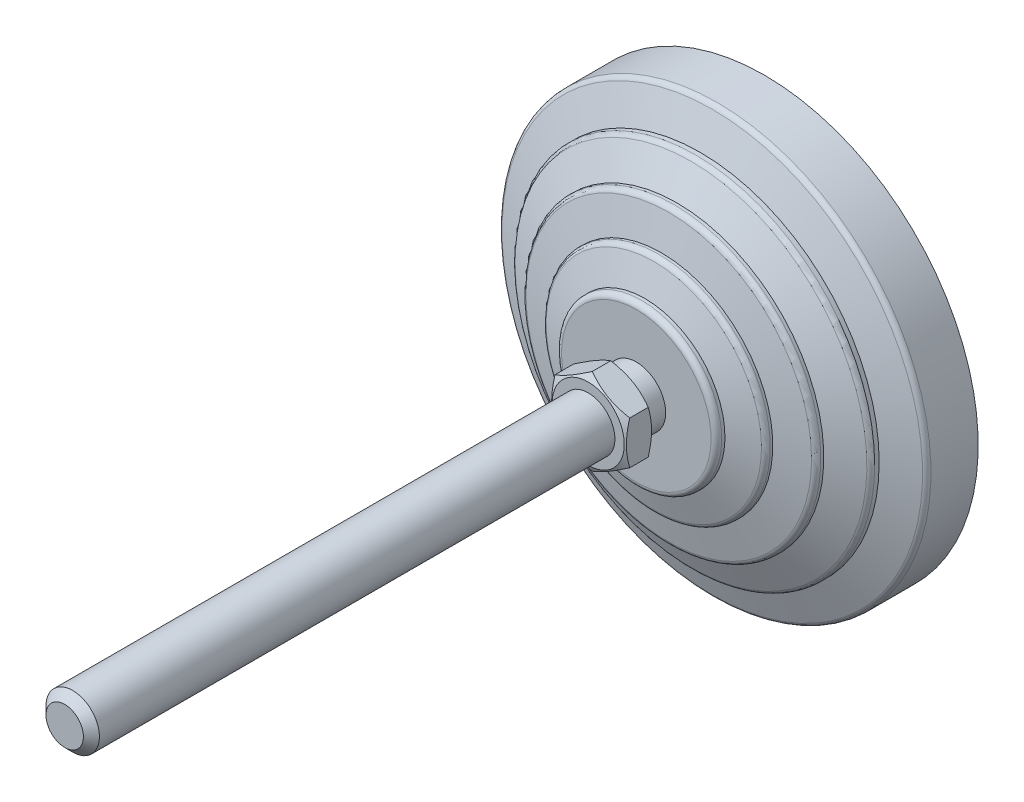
ISO-10303-21;
HEADER;
FILE_DESCRIPTION(('STEP AP214'),'2;1');
FILE_NAME('part.step','',(''),(''),'','','');
FILE_SCHEMA(('AUTOMOTIVE_DESIGN { 1 0 10303 214 1 1 1 1 }'));
ENDSEC;
DATA;
#1=APPLICATION_CONTEXT('core data for automotive mechanical design processes');
#2=APPLICATION_PROTOCOL_DEFINITION('international standard','automotive_design',2000,#1);
#3=PRODUCT_CONTEXT('',#1,'mechanical');
#4=PRODUCT('Part','Part','',(#3));
#5=PRODUCT_RELATED_PRODUCT_CATEGORY('part','',(#4));
#6=PRODUCT_DEFINITION_FORMATION('','',#4);
#7=PRODUCT_DEFINITION_CONTEXT('part definition',#1,'design');
#8=PRODUCT_DEFINITION('design','',#6,#7);
#9=PRODUCT_DEFINITION_SHAPE('','',#8);
#10=(LENGTH_UNIT() NAMED_UNIT(*) SI_UNIT(.MILLI.,.METRE.));
#11=(NAMED_UNIT(*) PLANE_ANGLE_UNIT() SI_UNIT($,.RADIAN.));
#12=(NAMED_UNIT(*) SI_UNIT($,.STERADIAN.) SOLID_ANGLE_UNIT());
#13=UNCERTAINTY_MEASURE_WITH_UNIT(LENGTH_MEASURE(1.E-05),#10,'distance_accuracy_value','');
#14=(GEOMETRIC_REPRESENTATION_CONTEXT(3) GLOBAL_UNCERTAINTY_ASSIGNED_CONTEXT((#13)) GLOBAL_UNIT_ASSIGNED_CONTEXT((#10,
#11,#12)) REPRESENTATION_CONTEXT('',''));
#15=CARTESIAN_POINT('',(0.,0.,0.));
#16=DIRECTION('',(0.,0.,1.));
#17=DIRECTION('',(1.,0.,0.));
#18=AXIS2_PLACEMENT_3D('',#15,#16,#17);
#19=CARTESIAN_POINT('',(-5.5,0.,31.));
#20=DIRECTION('',(0.,0.,1.));
#21=DIRECTION('',(0.,-1.,0.));
#22=AXIS2_PLACEMENT_3D('',#19,#20,#21);
#23=PLANE('',#22);
#24=CARTESIAN_POINT('',(0.,0.,31.));
#25=DIRECTION('',(0.,0.,-1.));
#26=DIRECTION('',(-1.,0.,0.));
#27=AXIS2_PLACEMENT_3D('',#24,#25,#26);
#28=CIRCLE('',#27,6.75);
#29=CARTESIAN_POINT('',(-6.75,0.,31.));
#30=VERTEX_POINT('',#29);
#31=EDGE_CURVE('E570',#30,#30,#28,.T.);
#32=ORIENTED_EDGE('',*,*,#31,.T.);
#33=EDGE_LOOP('',(#32));
#34=FACE_BOUND('',#33,.T.);
#35=CARTESIAN_POINT('',(0.,0.,31.));
#36=DIRECTION('',(0.,0.,-1.));
#37=DIRECTION('',(0.,1.,0.));
#38=AXIS2_PLACEMENT_3D('',#35,#36,#37);
#39=CIRCLE('',#38,5.5);
#40=CARTESIAN_POINT('',(0.,5.5,31.));
#41=VERTEX_POINT('',#40);
#42=EDGE_CURVE('E150',#41,#41,#39,.T.);
#43=ORIENTED_EDGE('',*,*,#42,.F.);
#44=EDGE_LOOP('',(#43));
#45=FACE_BOUND('',#44,.T.);
#46=ADVANCED_FACE('F14',(#34,#45),#23,.F.);
#47=CARTESIAN_POINT('',(0.,0.,0.));
#48=DIRECTION('',(0.,0.,-1.));
#49=DIRECTION('',(0.,1.,0.));
#50=AXIS2_PLACEMENT_3D('',#47,#48,#49);
#51=CYLINDRICAL_SURFACE('',#50,5.5);
#52=CARTESIAN_POINT('',(0.,0.,27.));
#53=DIRECTION('',(0.,0.,-1.));
#54=DIRECTION('',(0.,1.,0.));
#55=AXIS2_PLACEMENT_3D('',#52,#53,#54);
#56=CIRCLE('',#55,5.5);
#57=CARTESIAN_POINT('',(0.,5.5,27.));
#58=VERTEX_POINT('',#57);
#59=EDGE_CURVE('E147',#58,#58,#56,.T.);
#60=ORIENTED_EDGE('',*,*,#59,.F.);
#61=EDGE_LOOP('',(#60));
#62=FACE_BOUND('',#61,.T.);
#63=ORIENTED_EDGE('',*,*,#42,.T.);
#64=EDGE_LOOP('',(#63));
#65=FACE_BOUND('',#64,.T.);
#66=ADVANCED_FACE('F174',(#62,#65),#51,.T.);
#67=CARTESIAN_POINT('',(-5.5,0.,27.));
#68=DIRECTION('',(0.,0.,-1.));
#69=DIRECTION('',(0.,1.,0.));
#70=AXIS2_PLACEMENT_3D('',#67,#68,#69);
#71=PLANE('',#70);
#72=CARTESIAN_POINT('',(0.,0.,27.));
#73=DIRECTION('',(0.,0.,-1.));
#74=DIRECTION('',(0.,1.,0.));
#75=AXIS2_PLACEMENT_3D('',#72,#73,#74);
#76=CIRCLE('',#75,14.);
#77=CARTESIAN_POINT('',(0.,14.,27.));
#78=VERTEX_POINT('',#77);
#79=EDGE_CURVE('E144',#78,#78,#76,.T.);
#80=ORIENTED_EDGE('',*,*,#79,.F.);
#81=EDGE_LOOP('',(#80));
#82=FACE_BOUND('',#81,.T.);
#83=ORIENTED_EDGE('',*,*,#59,.T.);
#84=EDGE_LOOP('',(#83));
#85=FACE_BOUND('',#84,.T.);
#86=ADVANCED_FACE('F181',(#82,#85),#71,.F.);
#87=CARTESIAN_POINT('',(0.,0.,26.));
#88=DIRECTION('',(0.,0.,-1.));
#89=DIRECTION('',(0.,1.,0.));
#90=AXIS2_PLACEMENT_3D('',#87,#88,#89);
#91=TOROIDAL_SURFACE('',#90,14.,1.);
#92=CARTESIAN_POINT('',(0.,0.,26.));
#93=DIRECTION('',(0.,0.,-1.));
#94=DIRECTION('',(0.,1.,0.));
#95=AXIS2_PLACEMENT_3D('',#92,#93,#94);
#96=CIRCLE('',#95,15.);
#97=CARTESIAN_POINT('',(0.,15.,26.));
#98=VERTEX_POINT('',#97);
#99=EDGE_CURVE('E141',#98,#98,#96,.T.);
#100=ORIENTED_EDGE('',*,*,#99,.F.);
#101=EDGE_LOOP('',(#100));
#102=FACE_BOUND('',#101,.T.);
#103=ORIENTED_EDGE('',*,*,#79,.T.);
#104=EDGE_LOOP('',(#103));
#105=FACE_BOUND('',#104,.T.);
#106=ADVANCED_FACE('F433',(#102,#105),#91,.T.);
#107=CARTESIAN_POINT('',(0.,0.,0.));
#108=DIRECTION('',(0.,0.,-1.));
#109=DIRECTION('',(0.,1.,0.));
#110=AXIS2_PLACEMENT_3D('',#107,#108,#109);
#111=CYLINDRICAL_SURFACE('',#110,15.);
#112=CARTESIAN_POINT('',(0.,0.,25.4025287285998));
#113=DIRECTION('',(0.,0.,-1.));
#114=DIRECTION('',(0.,1.,0.));
#115=AXIS2_PLACEMENT_3D('',#112,#113,#114);
#116=CIRCLE('',#115,15.);
#117=CARTESIAN_POINT('',(0.,15.,25.4025287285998));
#118=VERTEX_POINT('',#117);
#119=EDGE_CURVE('E138',#118,#118,#116,.T.);
#120=ORIENTED_EDGE('',*,*,#119,.F.);
#121=EDGE_LOOP('',(#120));
#122=FACE_BOUND('',#121,.T.);
#123=ORIENTED_EDGE('',*,*,#99,.T.);
#124=EDGE_LOOP('',(#123));
#125=FACE_BOUND('',#124,.T.);
#126=ADVANCED_FACE('F423',(#122,#125),#111,.T.);
#127=CARTESIAN_POINT('',(0.,0.,25.4025287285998));
#128=DIRECTION('',(0.,0.,-1.));
#129=DIRECTION('',(0.,1.,0.));
#130=AXIS2_PLACEMENT_3D('',#127,#128,#129);
#131=CONICAL_SURFACE('',#130,15.,1.25589726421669);
#132=CARTESIAN_POINT('',(0.,0.,23.7216684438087));
#133=DIRECTION('',(0.,0.,-1.));
#134=DIRECTION('',(0.,1.,0.));
#135=AXIS2_PLACEMENT_3D('',#132,#133,#134);
#136=CIRCLE('',#135,20.16016354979);
#137=CARTESIAN_POINT('',(0.,20.16016354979,23.7216684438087));
#138=VERTEX_POINT('',#137);
#139=EDGE_CURVE('E135',#138,#138,#136,.T.);
#140=ORIENTED_EDGE('',*,*,#139,.F.);
#141=EDGE_LOOP('',(#140));
#142=FACE_BOUND('',#141,.T.);
#143=ORIENTED_EDGE('',*,*,#119,.T.);
#144=EDGE_LOOP('',(#143));
#145=FACE_BOUND('',#144,.T.);
#146=ADVANCED_FACE('F413',(#142,#145),#131,.T.);
#147=CARTESIAN_POINT('',(0.,0.,22.7708407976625));
#148=DIRECTION('',(0.,0.,-1.));
#149=DIRECTION('',(0.,1.,0.));
#150=AXIS2_PLACEMENT_3D('',#147,#148,#149);
#151=TOROIDAL_SURFACE('',#150,19.8504430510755,1.);
#152=CARTESIAN_POINT('',(0.,0.,22.7708407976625));
#153=DIRECTION('',(0.,0.,-1.));
#154=DIRECTION('',(0.,1.,0.));
#155=AXIS2_PLACEMENT_3D('',#152,#153,#154);
#156=CIRCLE('',#155,20.8504430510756);
#157=CARTESIAN_POINT('',(0.,20.8504430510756,22.7708407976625));
#158=VERTEX_POINT('',#157);
#159=EDGE_CURVE('E132',#158,#158,#156,.T.);
#160=ORIENTED_EDGE('',*,*,#159,.F.);
#161=EDGE_LOOP('',(#160));
#162=FACE_BOUND('',#161,.T.);
#163=ORIENTED_EDGE('',*,*,#139,.T.);
#164=EDGE_LOOP('',(#163));
#165=FACE_BOUND('',#164,.T.);
#166=ADVANCED_FACE('F403',(#162,#165),#151,.T.);
#167=CARTESIAN_POINT('',(0.,0.,0.));
#168=DIRECTION('',(0.,0.,-1.));
#169=DIRECTION('',(0.,1.,0.));
#170=AXIS2_PLACEMENT_3D('',#167,#168,#169);
#171=CYLINDRICAL_SURFACE('',#170,20.8504430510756);
#172=CARTESIAN_POINT('',(0.,0.,22.2987385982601));
#173=DIRECTION('',(0.,0.,-1.));
#174=DIRECTION('',(0.,1.,0.));
#175=AXIS2_PLACEMENT_3D('',#172,#173,#174);
#176=CIRCLE('',#175,20.8504430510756);
#177=CARTESIAN_POINT('',(0.,20.8504430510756,22.2987385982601));
#178=VERTEX_POINT('',#177);
#179=EDGE_CURVE('E129',#178,#178,#176,.T.);
#180=ORIENTED_EDGE('',*,*,#179,.F.);
#181=EDGE_LOOP('',(#180));
#182=FACE_BOUND('',#181,.T.);
#183=ORIENTED_EDGE('',*,*,#159,.T.);
#184=EDGE_LOOP('',(#183));
#185=FACE_BOUND('',#184,.T.);
#186=ADVANCED_FACE('F393',(#182,#185),#171,.T.);
#187=CARTESIAN_POINT('',(0.,0.,22.2987385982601));
#188=DIRECTION('',(0.,0.,-1.));
#189=DIRECTION('',(0.,1.,0.));
#190=AXIS2_PLACEMENT_3D('',#187,#188,#189);
#191=CONICAL_SURFACE('',#190,20.8504430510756,1.34067144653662);
#192=CARTESIAN_POINT('',(0.,0.,20.9217501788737));
#193=DIRECTION('',(0.,0.,-1.));
#194=DIRECTION('',(0.,1.,0.));
#195=AXIS2_PLACEMENT_3D('',#192,#193,#194);
#196=CIRCLE('',#195,26.728099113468);
#197=CARTESIAN_POINT('',(0.,26.728099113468,20.9217501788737));
#198=VERTEX_POINT('',#197);
#199=EDGE_CURVE('E126',#198,#198,#196,.T.);
#200=ORIENTED_EDGE('',*,*,#199,.F.);
#201=EDGE_LOOP('',(#200));
#202=FACE_BOUND('',#201,.T.);
#203=ORIENTED_EDGE('',*,*,#179,.T.);
#204=EDGE_LOOP('',(#203));
#205=FACE_BOUND('',#204,.T.);
#206=ADVANCED_FACE('F383',(#202,#205),#191,.T.);
#207=CARTESIAN_POINT('',(0.,0.,19.9481122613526));
#208=DIRECTION('',(0.,0.,-1.));
#209=DIRECTION('',(0.,1.,0.));
#210=AXIS2_PLACEMENT_3D('',#207,#208,#209);
#211=TOROIDAL_SURFACE('',#210,26.5,1.);
#212=CARTESIAN_POINT('',(0.,0.,19.9481122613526));
#213=DIRECTION('',(0.,0.,-1.));
#214=DIRECTION('',(0.,1.,0.));
#215=AXIS2_PLACEMENT_3D('',#212,#213,#214);
#216=CIRCLE('',#215,27.5);
#217=CARTESIAN_POINT('',(0.,27.5,19.9481122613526));
#218=VERTEX_POINT('',#217);
#219=EDGE_CURVE('E123',#218,#218,#216,.T.);
#220=ORIENTED_EDGE('',*,*,#219,.F.);
#221=EDGE_LOOP('',(#220));
#222=FACE_BOUND('',#221,.T.);
#223=ORIENTED_EDGE('',*,*,#199,.T.);
#224=EDGE_LOOP('',(#223));
#225=FACE_BOUND('',#224,.T.);
#226=ADVANCED_FACE('F373',(#222,#225),#211,.T.);
#227=CARTESIAN_POINT('',(0.,0.,0.));
#228=DIRECTION('',(0.,0.,-1.));
#229=DIRECTION('',(0.,1.,0.));
#230=AXIS2_PLACEMENT_3D('',#227,#228,#229);
#231=CYLINDRICAL_SURFACE('',#230,27.5);
#232=CARTESIAN_POINT('',(0.,0.,19.4025287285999));
#233=DIRECTION('',(0.,0.,-1.));
#234=DIRECTION('',(0.,1.,0.));
#235=AXIS2_PLACEMENT_3D('',#232,#233,#234);
#236=CIRCLE('',#235,27.5);
#237=CARTESIAN_POINT('',(0.,27.5,19.4025287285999));
#238=VERTEX_POINT('',#237);
#239=EDGE_CURVE('E120',#238,#238,#236,.T.);
#240=ORIENTED_EDGE('',*,*,#239,.F.);
#241=EDGE_LOOP('',(#240));
#242=FACE_BOUND('',#241,.T.);
#243=ORIENTED_EDGE('',*,*,#219,.T.);
#244=EDGE_LOOP('',(#243));
#245=FACE_BOUND('',#244,.T.);
#246=ADVANCED_FACE('F363',(#242,#245),#231,.T.);
#247=CARTESIAN_POINT('',(0.,0.,19.4025287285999));
#248=DIRECTION('',(0.,0.,-1.));
#249=DIRECTION('',(0.,1.,0.));
#250=AXIS2_PLACEMENT_3D('',#247,#248,#249);
#251=CONICAL_SURFACE('',#250,27.5,1.12022914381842);
#252=CARTESIAN_POINT('',(0.,0.,16.7730910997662));
#253=DIRECTION('',(0.,0.,-1.));
#254=DIRECTION('',(0.,1.,0.));
#255=AXIS2_PLACEMENT_3D('',#252,#253,#254);
#256=CIRCLE('',#255,32.935476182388);
#257=CARTESIAN_POINT('',(0.,32.935476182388,16.7730910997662));
#258=VERTEX_POINT('',#257);
#259=EDGE_CURVE('E117',#258,#258,#256,.T.);
#260=ORIENTED_EDGE('',*,*,#259,.F.);
#261=EDGE_LOOP('',(#260));
#262=FACE_BOUND('',#261,.T.);
#263=ORIENTED_EDGE('',*,*,#239,.T.);
#264=EDGE_LOOP('',(#263));
#265=FACE_BOUND('',#264,.T.);
#266=ADVANCED_FACE('F353',(#262,#265),#251,.T.);
#267=CARTESIAN_POINT('',(0.,0.,15.8728908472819));
#268=DIRECTION('',(0.,0.,-1.));
#269=DIRECTION('',(0.,1.,0.));
#270=AXIS2_PLACEMENT_3D('',#267,#268,#269);
#271=TOROIDAL_SURFACE('',#270,32.5,1.);
#272=CARTESIAN_POINT('',(0.,0.,15.8728908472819));
#273=DIRECTION('',(0.,0.,-1.));
#274=DIRECTION('',(0.,1.,0.));
#275=AXIS2_PLACEMENT_3D('',#272,#273,#274);
#276=CIRCLE('',#275,33.5);
#277=CARTESIAN_POINT('',(0.,33.5,15.8728908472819));
#278=VERTEX_POINT('',#277);
#279=EDGE_CURVE('E114',#278,#278,#276,.T.);
#280=ORIENTED_EDGE('',*,*,#279,.F.);
#281=EDGE_LOOP('',(#280));
#282=FACE_BOUND('',#281,.T.);
#283=ORIENTED_EDGE('',*,*,#259,.T.);
#284=EDGE_LOOP('',(#283));
#285=FACE_BOUND('',#284,.T.);
#286=ADVANCED_FACE('F343',(#282,#285),#271,.T.);
#287=CARTESIAN_POINT('',(0.,0.,0.));
#288=DIRECTION('',(0.,0.,-1.));
#289=DIRECTION('',(0.,1.,0.));
#290=AXIS2_PLACEMENT_3D('',#287,#288,#289);
#291=CYLINDRICAL_SURFACE('',#290,33.5);
#292=CARTESIAN_POINT('',(0.,0.,15.0315037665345));
#293=DIRECTION('',(0.,0.,-1.));
#294=DIRECTION('',(0.,1.,0.));
#295=AXIS2_PLACEMENT_3D('',#292,#293,#294);
#296=CIRCLE('',#295,33.5);
#297=CARTESIAN_POINT('',(0.,33.5,15.0315037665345));
#298=VERTEX_POINT('',#297);
#299=EDGE_CURVE('E111',#298,#298,#296,.T.);
#300=ORIENTED_EDGE('',*,*,#299,.F.);
#301=EDGE_LOOP('',(#300));
#302=FACE_BOUND('',#301,.T.);
#303=ORIENTED_EDGE('',*,*,#279,.T.);
#304=EDGE_LOOP('',(#303));
#305=FACE_BOUND('',#304,.T.);
#306=ADVANCED_FACE('F333',(#302,#305),#291,.T.);
#307=CARTESIAN_POINT('',(0.,0.,15.0315037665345));
#308=DIRECTION('',(0.,0.,-1.));
#309=DIRECTION('',(0.,1.,0.));
#310=AXIS2_PLACEMENT_3D('',#307,#308,#309);
#311=CONICAL_SURFACE('',#310,33.5,1.20362249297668);
#312=CARTESIAN_POINT('',(0.,0.,12.7780502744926));
#313=DIRECTION('',(0.,0.,-1.));
#314=DIRECTION('',(0.,1.,0.));
#315=AXIS2_PLACEMENT_3D('',#312,#313,#314);
#316=CIRCLE('',#315,39.3589790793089);
#317=CARTESIAN_POINT('',(0.,39.3589790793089,12.7780502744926));
#318=VERTEX_POINT('',#317);
#319=EDGE_CURVE('E108',#318,#318,#316,.T.);
#320=ORIENTED_EDGE('',*,*,#319,.F.);
#321=EDGE_LOOP('',(#320));
#322=FACE_BOUND('',#321,.T.);
#323=ORIENTED_EDGE('',*,*,#299,.T.);
#324=EDGE_LOOP('',(#323));
#325=FACE_BOUND('',#324,.T.);
#326=ADVANCED_FACE('F323',(#322,#325),#311,.T.);
#327=CARTESIAN_POINT('',(0.,0.,11.8447046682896));
#328=DIRECTION('',(0.,0.,-1.));
#329=DIRECTION('',(0.,1.,0.));
#330=AXIS2_PLACEMENT_3D('',#327,#328,#329);
#331=TOROIDAL_SURFACE('',#330,39.,1.);
#332=CARTESIAN_POINT('',(0.,0.,11.8447046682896));
#333=DIRECTION('',(0.,0.,-1.));
#334=DIRECTION('',(0.,1.,0.));
#335=AXIS2_PLACEMENT_3D('',#332,#333,#334);
#336=CIRCLE('',#335,40.);
#337=CARTESIAN_POINT('',(0.,40.,11.8447046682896));
#338=VERTEX_POINT('',#337);
#339=EDGE_CURVE('E105',#338,#338,#336,.T.);
#340=ORIENTED_EDGE('',*,*,#339,.F.);
#341=EDGE_LOOP('',(#340));
#342=FACE_BOUND('',#341,.T.);
#343=ORIENTED_EDGE('',*,*,#319,.T.);
#344=EDGE_LOOP('',(#343));
#345=FACE_BOUND('',#344,.T.);
#346=ADVANCED_FACE('F313',(#342,#345),#331,.T.);
#347=CARTESIAN_POINT('',(0.,0.,0.));
#348=DIRECTION('',(0.,0.,-1.));
#349=DIRECTION('',(0.,1.,0.));
#350=AXIS2_PLACEMENT_3D('',#347,#348,#349);
#351=CYLINDRICAL_SURFACE('',#350,40.);
#352=CARTESIAN_POINT('',(0.,0.,2.99999999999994));
#353=DIRECTION('',(0.,0.,-1.));
#354=DIRECTION('',(0.,1.,0.));
#355=AXIS2_PLACEMENT_3D('',#352,#353,#354);
#356=CIRCLE('',#355,40.);
#357=CARTESIAN_POINT('',(0.,40.,2.99999999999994));
#358=VERTEX_POINT('',#357);
#359=EDGE_CURVE('E102',#358,#358,#356,.T.);
#360=ORIENTED_EDGE('',*,*,#359,.F.);
#361=EDGE_LOOP('',(#360));
#362=FACE_BOUND('',#361,.T.);
#363=ORIENTED_EDGE('',*,*,#339,.T.);
#364=EDGE_LOOP('',(#363));
#365=FACE_BOUND('',#364,.T.);
#366=ADVANCED_FACE('F303',(#362,#365),#351,.T.);
#367=CARTESIAN_POINT('',(-33.5,0.,2.99999999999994));
#368=DIRECTION('',(0.,0.,1.));
#369=DIRECTION('',(0.,-1.,0.));
#370=AXIS2_PLACEMENT_3D('',#367,#368,#369);
#371=PLANE('',#370);
#372=CARTESIAN_POINT('',(0.,0.,2.99999999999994));
#373=DIRECTION('',(0.,0.,-1.));
#374=DIRECTION('',(0.,1.,0.));
#375=AXIS2_PLACEMENT_3D('',#372,#373,#374);
#376=CIRCLE('',#375,33.5);
#377=CARTESIAN_POINT('',(0.,33.5,2.99999999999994));
#378=VERTEX_POINT('',#377);
#379=EDGE_CURVE('E99',#378,#378,#376,.T.);
#380=ORIENTED_EDGE('',*,*,#379,.F.);
#381=EDGE_LOOP('',(#380));
#382=FACE_BOUND('',#381,.T.);
#383=ORIENTED_EDGE('',*,*,#359,.T.);
#384=EDGE_LOOP('',(#383));
#385=FACE_BOUND('',#384,.T.);
#386=ADVANCED_FACE('F293',(#382,#385),#371,.F.);
#387=CARTESIAN_POINT('',(0.,0.,0.));
#388=DIRECTION('',(0.,0.,-1.));
#389=DIRECTION('',(0.,1.,0.));
#390=AXIS2_PLACEMENT_3D('',#387,#388,#389);
#391=CYLINDRICAL_SURFACE('',#390,33.5);
#392=CARTESIAN_POINT('',(0.,0.,0.));
#393=DIRECTION('',(0.,0.,-1.));
#394=DIRECTION('',(0.,1.,0.));
#395=AXIS2_PLACEMENT_3D('',#392,#393,#394);
#396=CIRCLE('',#395,33.5);
#397=CARTESIAN_POINT('',(0.,33.5,0.));
#398=VERTEX_POINT('',#397);
#399=EDGE_CURVE('E96',#398,#398,#396,.T.);
#400=ORIENTED_EDGE('',*,*,#399,.F.);
#401=EDGE_LOOP('',(#400));
#402=FACE_BOUND('',#401,.T.);
#403=ORIENTED_EDGE('',*,*,#379,.T.);
#404=EDGE_LOOP('',(#403));
#405=FACE_BOUND('',#404,.T.);
#406=ADVANCED_FACE('F282',(#402,#405),#391,.T.);
#407=CARTESIAN_POINT('',(0.,0.,0.));
#408=DIRECTION('',(0.,0.,1.));
#409=DIRECTION('',(0.,-1.,0.));
#410=AXIS2_PLACEMENT_3D('',#407,#408,#409);
#411=PLANE('',#410);
#412=ORIENTED_EDGE('',*,*,#399,.T.);
#413=EDGE_LOOP('',(#412));
#414=FACE_BOUND('',#413,.T.);
#415=ADVANCED_FACE('F172',(#414),#411,.F.);
#416=CARTESIAN_POINT('',(0.,0.,32.532965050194));
#417=DIRECTION('',(0.,0.,1.));
#418=DIRECTION('',(1.,0.,0.));
#419=AXIS2_PLACEMENT_3D('',#416,#417,#418);
#420=CONICAL_SURFACE('',#419,9.40517335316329,1.0471975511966);
#421=CARTESIAN_POINT('',(0.256261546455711,-8.23085644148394,31.8572755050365));
#422=CARTESIAN_POINT('',(-0.0703622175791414,-8.04228012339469,31.7425720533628));
#423=CARTESIAN_POINT('',(-0.400040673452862,-7.85194017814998,31.6375938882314));
#424=CARTESIAN_POINT('',(-1.06577529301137,-7.46757811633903,31.4533009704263));
#425=CARTESIAN_POINT('',(-1.4018483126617,-7.27354626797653,31.374068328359));
#426=CARTESIAN_POINT('',(-1.90453869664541,-6.98331783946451,31.2806332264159));
#427=CARTESIAN_POINT('',(-2.06940897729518,-6.88812993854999,31.253943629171));
#428=CARTESIAN_POINT('',(-2.40001217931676,-6.69725609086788,31.2089143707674));
#429=CARTESIAN_POINT('',(-2.56574510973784,-6.60157013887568,31.1905747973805));
#430=CARTESIAN_POINT('',(-2.89750385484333,-6.41002913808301,31.162768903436));
#431=CARTESIAN_POINT('',(-3.06352876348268,-6.3141746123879,31.1532882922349));
#432=CARTESIAN_POINT('',(-3.39578221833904,-6.1223479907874,31.1434202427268));
#433=CARTESIAN_POINT('',(-3.5620107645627,-6.02637589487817,31.1430328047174));
#434=CARTESIAN_POINT('',(-3.90470011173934,-5.82852410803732,31.1516256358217));
#435=CARTESIAN_POINT('',(-4.0811499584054,-5.7266507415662,31.1611939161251));
#436=CARTESIAN_POINT('',(-4.43343002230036,-5.52326175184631,31.1903044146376));
#437=CARTESIAN_POINT('',(-4.60926021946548,-5.42174614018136,31.2098469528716));
#438=CARTESIAN_POINT('',(-4.96026978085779,-5.21909067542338,31.2583557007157));
#439=CARTESIAN_POINT('',(-5.13544729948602,-5.1179518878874,31.2873395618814));
#440=CARTESIAN_POINT('',(-5.48457213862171,-4.91638456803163,31.3539266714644));
#441=CARTESIAN_POINT('',(-5.65851936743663,-4.81595608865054,31.3915305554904));
#442=CARTESIAN_POINT('',(-6.01055140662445,-4.61271029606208,31.4757827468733));
#443=CARTESIAN_POINT('',(-6.1885909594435,-4.5099191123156,31.5226815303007));
#444=CARTESIAN_POINT('',(-6.54313687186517,-4.30522193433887,31.623701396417));
#445=CARTESIAN_POINT('',(-6.71964306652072,-4.20331603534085,31.6778232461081));
#446=CARTESIAN_POINT('',(-7.07038871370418,-4.00081294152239,31.7920852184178));
#447=CARTESIAN_POINT('',(-7.24463452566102,-3.90021207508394,31.8521994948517));
#448=CARTESIAN_POINT('',(-7.59160761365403,-3.69988706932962,31.9777703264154));
#449=CARTESIAN_POINT('',(-7.76433543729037,-3.60016261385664,32.0432248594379));
#450=CARTESIAN_POINT('',(-7.93637382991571,-3.50083620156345,32.1109419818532));
#451=B_SPLINE_CURVE_WITH_KNOTS('',3,(#421,#422,#423,#424,#425,#426,#427,#428,#429,#430,#431,
#432,#433,#434,#435,#436,#437,#438,#439,#440,#441,#442,#443,#444,#445,#446,#447,#448,#449,#450),
.UNSPECIFIED.,.F.,.F.,(4,2,2,2,2,2,2,2,2,2,2,2,2,2,4),(0.,1.18337249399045,2.37048291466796,
2.94702671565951,3.52357657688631,4.09919477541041,4.674812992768,5.2864694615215,
5.89814555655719,6.51097187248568,7.12384339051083,7.75628626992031,8.38879636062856,
9.01868757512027,9.64834137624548),.UNSPECIFIED.);
#452=CARTESIAN_POINT('',(0.,-8.08290376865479,31.7695523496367));
#453=VERTEX_POINT('',#452);
#454=CARTESIAN_POINT('',(-7.,-4.04145188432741,31.7695523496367));
#455=VERTEX_POINT('',#454);
#456=EDGE_CURVE('E73',#453,#455,#451,.T.);
#457=ORIENTED_EDGE('',*,*,#456,.T.);
#458=CARTESIAN_POINT('',(-7.,-10.8046314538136,34.5356971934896));
#459=CARTESIAN_POINT('',(-7.,-10.4993196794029,34.3878002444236));
#460=CARTESIAN_POINT('',(-7.,-10.1933015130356,34.2413362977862));
#461=CARTESIAN_POINT('',(-7.,-9.57947652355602,33.9520814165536));
#462=CARTESIAN_POINT('',(-7.,-9.27166942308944,33.8092910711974));
#463=CARTESIAN_POINT('',(-7.,-8.65228007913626,33.5274610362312));
#464=CARTESIAN_POINT('',(-7.,-8.3406863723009,33.3884464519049));
#465=CARTESIAN_POINT('',(-7.,-7.71500268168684,33.1161751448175));
#466=CARTESIAN_POINT('',(-7.,-7.40091281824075,32.9829181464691));
#467=CARTESIAN_POINT('',(-7.,-6.75980125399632,32.7196030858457));
#468=CARTESIAN_POINT('',(-7.,-6.43268354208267,32.5897774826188));
#469=CARTESIAN_POINT('',(-7.,-5.77460299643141,32.3400765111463));
#470=CARTESIAN_POINT('',(-7.,-5.44363973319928,32.2202022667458));
#471=CARTESIAN_POINT('',(-7.,-4.77797373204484,31.9935889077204));
#472=CARTESIAN_POINT('',(-7.,-4.44328029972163,31.8868227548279));
#473=CARTESIAN_POINT('',(-7.,-3.76910513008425,31.6898837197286));
#474=CARTESIAN_POINT('',(-7.,-3.42962495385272,31.5997055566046));
#475=CARTESIAN_POINT('',(-7.,-2.74749948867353,31.4407863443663));
#476=CARTESIAN_POINT('',(-7.,-2.40488155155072,31.371931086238));
#477=CARTESIAN_POINT('',(-7.,-1.88787605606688,31.2876471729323));
#478=CARTESIAN_POINT('',(-7.,-1.71501470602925,31.2627178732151));
#479=CARTESIAN_POINT('',(-7.,-1.36845032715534,31.2196823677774));
#480=CARTESIAN_POINT('',(-7.,-1.1947473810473,31.2015755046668));
#481=CARTESIAN_POINT('',(-7.,-0.848979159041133,31.1727700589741));
#482=CARTESIAN_POINT('',(-7.,-0.676921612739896,31.161979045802));
#483=CARTESIAN_POINT('',(-7.,-0.332504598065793,31.1476790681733));
#484=CARTESIAN_POINT('',(-7.,-0.160145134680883,31.1441699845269));
#485=CARTESIAN_POINT('',(-7.,0.184568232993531,31.144517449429));
#486=CARTESIAN_POINT('',(-7.,0.356922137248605,31.1483740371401));
#487=CARTESIAN_POINT('',(-7.,0.701315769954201,31.1633594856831));
#488=CARTESIAN_POINT('',(-7.,0.87335548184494,31.1744887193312));
#489=CARTESIAN_POINT('',(-7.,1.28838398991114,31.2098755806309));
#490=CARTESIAN_POINT('',(-7.,1.53107736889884,31.2376706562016));
#491=CARTESIAN_POINT('',(-7.,2.01461761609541,31.3062050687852));
#492=CARTESIAN_POINT('',(-7.,2.25546422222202,31.3469462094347));
#493=CARTESIAN_POINT('',(-7.,2.97498391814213,31.4864245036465));
#494=CARTESIAN_POINT('',(-7.,3.45035901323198,31.602389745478));
#495=CARTESIAN_POINT('',(-7.,4.16110581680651,31.8029138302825));
#496=CARTESIAN_POINT('',(-7.,4.40017835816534,31.8751048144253));
#497=CARTESIAN_POINT('',(-7.,4.87600044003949,32.0268426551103));
#498=CARTESIAN_POINT('',(-7.,5.11274996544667,32.106389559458));
#499=CARTESIAN_POINT('',(-7.,5.58400326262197,32.2715747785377));
#500=CARTESIAN_POINT('',(-7.,5.81850777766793,32.357210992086));
#501=CARTESIAN_POINT('',(-7.,6.28558346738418,32.5335814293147));
#502=CARTESIAN_POINT('',(-7.,6.51815466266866,32.6243155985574));
#503=CARTESIAN_POINT('',(-7.,7.05860638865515,32.840901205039));
#504=CARTESIAN_POINT('',(-7.,7.36582501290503,32.968401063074));
#505=CARTESIAN_POINT('',(-7.,7.97772216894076,33.2293737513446));
#506=CARTESIAN_POINT('',(-7.,8.28240055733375,33.3628469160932));
#507=CARTESIAN_POINT('',(-7.,8.8896735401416,33.6345900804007));
#508=CARTESIAN_POINT('',(-7.,9.19226773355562,33.7728609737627));
#509=CARTESIAN_POINT('',(-7.,9.79566735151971,34.0532588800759));
#510=CARTESIAN_POINT('',(-7.,10.0964727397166,34.1953859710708));
#511=CARTESIAN_POINT('',(-7.,10.696879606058,34.4829283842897));
#512=CARTESIAN_POINT('',(-7.,10.9964795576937,34.6283468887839));
#513=CARTESIAN_POINT('',(-7.,11.5944048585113,34.9217834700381));
#514=CARTESIAN_POINT('',(-7.,11.8927301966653,35.0698015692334));
#515=CARTESIAN_POINT('',(-7.,12.786019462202,35.5170390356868));
#516=CARTESIAN_POINT('',(-7.,13.379371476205,35.8194776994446));
#517=CARTESIAN_POINT('',(-7.,14.5147033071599,36.4055322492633));
#518=CARTESIAN_POINT('',(-7.,15.0569291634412,36.6886735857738));
#519=CARTESIAN_POINT('',(-7.,16.139359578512,37.2588338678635));
#520=CARTESIAN_POINT('',(-7.,16.6795640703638,37.5458529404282));
#521=CARTESIAN_POINT('',(-7.,17.7571099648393,38.122168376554));
#522=CARTESIAN_POINT('',(-7.,18.2944551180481,38.4114577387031));
#523=CARTESIAN_POINT('',(-7.,19.3678480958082,38.9923673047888));
#524=CARTESIAN_POINT('',(-7.,19.9038959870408,39.2839873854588));
#525=CARTESIAN_POINT('',(-7.,20.4394639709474,39.576480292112));
#526=B_SPLINE_CURVE_WITH_KNOTS('',3,(#458,#459,#460,#461,#462,#463,#464,#465,#466,#467,#468,
#469,#470,#471,#472,#473,#474,#475,#476,#477,#478,#479,#480,#481,#482,#483,#484,#485,#486,#487,
#488,#489,#490,#491,#492,#493,#494,#495,#496,#497,#498,#499,#500,#501,#502,#503,#504,#505,#506,
#507,#508,#509,#510,#511,#512,#513,#514,#515,#516,#517,#518,#519,#520,#521,#522,#523,#524,#525),
.UNSPECIFIED.,.F.,.F.,(4,2,2,2,2,2,2,2,2,2,2,2,2,2,2,2,2,2,2,2,2,2,2,2,2,2,2,2,2,2,2,2,2,4),(0.,
1.01775482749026,2.03567189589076,3.05921756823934,4.08271419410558,5.1384040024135,
6.19421287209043,7.24780595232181,8.30106303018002,9.3485770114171,9.87241262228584,
10.396197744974,10.9132353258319,11.4302644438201,11.9472963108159,12.4643546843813,
13.196779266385,13.9293059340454,15.395193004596,16.1443352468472,16.8934823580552,
17.6423722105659,18.3912540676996,19.3890453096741,20.3868924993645,21.3849265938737,
22.3829809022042,23.3820452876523,24.381118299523,26.3790150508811,28.2141007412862,
30.0492466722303,31.8800473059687,33.7107517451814),.UNSPECIFIED.);
#527=CARTESIAN_POINT('',(-7.,4.04145188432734,31.7695523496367));
#528=VERTEX_POINT('',#527);
#529=EDGE_CURVE('E81',#455,#528,#526,.T.);
#530=ORIENTED_EDGE('',*,*,#529,.T.);
#531=CARTESIAN_POINT('',(-12.6904976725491,0.756041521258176,34.4427387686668));
#532=CARTESIAN_POINT('',(-12.4217194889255,0.911220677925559,34.2932085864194));
#533=CARTESIAN_POINT('',(-12.1522876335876,1.06677723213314,34.1452150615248));
#534=CARTESIAN_POINT('',(-11.6117555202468,1.37885359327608,33.8531975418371));
#535=CARTESIAN_POINT('',(-11.3406549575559,1.53537357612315,33.709174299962));
#536=CARTESIAN_POINT('',(-10.7948069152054,1.85051909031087,33.425156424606));
#537=CARTESIAN_POINT('',(-10.5200472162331,2.00915167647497,33.2851929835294));
#538=CARTESIAN_POINT('',(-9.96819039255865,2.32776636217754,33.0115769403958));
#539=CARTESIAN_POINT('',(-9.69109340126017,2.48774838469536,32.8779239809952));
#540=CARTESIAN_POINT('',(-9.13151700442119,2.8108199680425,32.6174515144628));
#541=CARTESIAN_POINT('',(-8.84901153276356,2.97392457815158,32.4907062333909));
#542=CARTESIAN_POINT('',(-8.280564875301,3.30211740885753,32.2477300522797));
#543=CARTESIAN_POINT('',(-7.99462328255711,3.46720586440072,32.1315004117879));
#544=CARTESIAN_POINT('',(-7.41950981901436,3.7992477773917,31.9129166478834));
#545=CARTESIAN_POINT('',(-7.1303474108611,3.96619577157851,31.8105297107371));
#546=CARTESIAN_POINT('',(-6.54787222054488,4.30248797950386,31.6231851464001));
#547=CARTESIAN_POINT('',(-6.25456091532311,4.47183134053,31.5382214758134));
#548=CARTESIAN_POINT('',(-5.66827395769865,4.81032427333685,31.3913176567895));
#549=CARTESIAN_POINT('',(-5.37536316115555,4.97943640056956,31.3290420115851));
#550=CARTESIAN_POINT('',(-4.9335928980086,5.23449258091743,31.2547165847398));
#551=CARTESIAN_POINT('',(-4.78591595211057,5.31975390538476,31.2331212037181));
#552=CARTESIAN_POINT('',(-4.48994030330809,5.49063552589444,31.1967211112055));
#553=CARTESIAN_POINT('',(-4.3416416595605,5.57625578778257,31.1819157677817));
#554=CARTESIAN_POINT('',(-4.04546762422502,5.74725194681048,31.1594856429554));
#555=CARTESIAN_POINT('',(-3.89759449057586,5.83262654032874,31.1518212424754));
#556=CARTESIAN_POINT('',(-3.60170072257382,6.00346088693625,31.1437048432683));
#557=CARTESIAN_POINT('',(-3.4536800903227,6.08892063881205,31.1432527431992));
#558=CARTESIAN_POINT('',(-3.15779168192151,6.25975189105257,31.1495714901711));
#559=CARTESIAN_POINT('',(-3.00992387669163,6.34512340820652,31.1563405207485));
#560=CARTESIAN_POINT('',(-2.71455540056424,6.5156544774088,31.1769411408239));
#561=CARTESIAN_POINT('',(-2.56705475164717,6.60081401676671,31.1907731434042));
#562=CARTESIAN_POINT('',(-2.20310564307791,6.8109401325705,31.2333388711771));
#563=CARTESIAN_POINT('',(-1.98699775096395,6.9357100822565,31.2660252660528));
#564=CARTESIAN_POINT('',(-1.55661089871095,7.18419404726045,31.344682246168));
#565=CARTESIAN_POINT('',(-1.34233224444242,7.30790788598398,31.3906550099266));
#566=CARTESIAN_POINT('',(-0.701797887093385,7.67772056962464,31.5461781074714));
#567=CARTESIAN_POINT('',(-0.278697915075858,7.92199745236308,31.6732210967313));
#568=CARTESIAN_POINT('',(0.353836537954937,8.28719138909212,31.8902975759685));
#569=CARTESIAN_POINT('',(0.566614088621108,8.41003856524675,31.9680643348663));
#570=CARTESIAN_POINT('',(0.990114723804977,8.65454677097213,32.1308608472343));
#571=CARTESIAN_POINT('',(1.2008376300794,8.77620769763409,32.2158912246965));
#572=CARTESIAN_POINT('',(1.61917189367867,9.01773309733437,32.3914310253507));
#573=CARTESIAN_POINT('',(1.82679418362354,9.13760388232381,32.4819060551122));
#574=CARTESIAN_POINT('',(2.24030424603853,9.37634402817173,32.6677761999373));
#575=CARTESIAN_POINT('',(2.4461925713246,9.49521370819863,32.7631696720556));
#576=CARTESIAN_POINT('',(2.65135594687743,9.61366483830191,32.8605541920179));
#577=B_SPLINE_CURVE_WITH_KNOTS('',3,(#531,#532,#533,#534,#535,#536,#537,#538,#539,#540,#541,
#542,#543,#544,#545,#546,#547,#548,#549,#550,#551,#552,#553,#554,#555,#556,#557,#558,#559,#560,
#561,#562,#563,#564,#565,#566,#567,#568,#569,#570,#571,#572,#573,#574,#575,#576),.UNSPECIFIED.,
.F.,.F.,(4,2,2,2,2,2,2,2,2,2,2,2,2,2,2,2,2,2,2,2,2,2,4),(0.,1.03352089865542,2.06723646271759,
3.10748139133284,4.14766734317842,5.19742814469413,6.24731451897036,7.29466681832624,
8.34165521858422,9.37246434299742,9.88800406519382,10.4034957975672,10.9161101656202,
11.428717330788,11.941195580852,12.4537038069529,13.2082845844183,13.9629891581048,
15.475363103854,16.2484336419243,17.0215706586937,17.7902528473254,18.5586799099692),.UNSPECIFIED.);
#578=CARTESIAN_POINT('',(0.,8.08290376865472,31.7695523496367));
#579=VERTEX_POINT('',#578);
#580=EDGE_CURVE('E525',#528,#579,#577,.T.);
#581=ORIENTED_EDGE('',*,*,#580,.T.);
#582=CARTESIAN_POINT('',(-0.943187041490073,8.62745306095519,32.1136257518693));
#583=CARTESIAN_POINT('',(-0.771051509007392,8.52807056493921,32.0458027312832));
#584=CARTESIAN_POINT('',(-0.598226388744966,8.42828993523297,31.9802405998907));
#585=CARTESIAN_POINT('',(-0.251057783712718,8.22785204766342,31.8544515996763));
#586=CARTESIAN_POINT('',(-0.0767137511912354,8.12719447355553,31.7942267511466));
#587=CARTESIAN_POINT('',(0.274231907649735,7.92457590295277,31.6797401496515));
#588=CARTESIAN_POINT('',(0.450839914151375,7.82261122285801,31.6255042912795));
#589=CARTESIAN_POINT('',(0.805591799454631,7.61779512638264,31.5242551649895));
#590=CARTESIAN_POINT('',(0.983735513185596,7.51494380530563,31.4772411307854));
#591=CARTESIAN_POINT('',(1.33597247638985,7.31157969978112,31.3927633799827));
#592=CARTESIAN_POINT('',(1.51002034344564,7.21109311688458,31.3550490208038));
#593=CARTESIAN_POINT('',(1.85935014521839,7.00940746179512,31.2882435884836));
#594=CARTESIAN_POINT('',(2.03463198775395,6.90820844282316,31.2591518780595));
#595=CARTESIAN_POINT('',(2.38585381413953,6.70543042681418,31.2104333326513));
#596=CARTESIAN_POINT('',(2.56179194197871,6.6038525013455,31.1907888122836));
#597=CARTESIAN_POINT('',(2.91429218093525,6.40033639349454,31.1614833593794));
#598=CARTESIAN_POINT('',(3.09085427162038,6.2983982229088,31.1518221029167));
#599=CARTESIAN_POINT('',(3.43357393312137,6.10052893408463,31.1430656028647));
#600=CARTESIAN_POINT('',(3.59972012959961,6.00460438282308,31.143371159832));
#601=CARTESIAN_POINT('',(3.93181248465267,5.81287077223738,31.1530677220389));
#602=CARTESIAN_POINT('',(4.09775864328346,5.71706171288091,31.162458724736));
#603=CARTESIAN_POINT('',(4.42936300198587,5.52560984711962,31.1900802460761));
#604=CARTESIAN_POINT('',(4.59502030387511,5.42996755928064,31.2083250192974));
#605=CARTESIAN_POINT('',(4.92547577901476,5.23917900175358,31.2531622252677));
#606=CARTESIAN_POINT('',(5.09027396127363,5.14403272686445,31.2797545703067));
#607=CARTESIAN_POINT('',(5.59274036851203,4.85393361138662,31.37289082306));
#608=CARTESIAN_POINT('',(5.92866649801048,4.65998657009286,31.4519212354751));
#609=CARTESIAN_POINT('',(6.59411858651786,4.27578762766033,31.6358207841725));
#610=CARTESIAN_POINT('',(6.92366132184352,4.08552604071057,31.7406080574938));
#611=CARTESIAN_POINT('',(7.25015005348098,3.89702768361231,31.855130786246));
#612=B_SPLINE_CURVE_WITH_KNOTS('',3,(#582,#583,#584,#585,#586,#587,#588,#589,#590,#591,#592,
#593,#594,#595,#596,#597,#598,#599,#600,#601,#602,#603,#604,#605,#606,#607,#608,#609,#610,#611),
.UNSPECIFIED.,.F.,.F.,(4,2,2,2,2,2,2,2,2,2,2,2,2,2,4),(0.,0.630074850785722,1.26038719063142,
1.89332610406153,2.52619781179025,3.13947307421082,3.75270299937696,4.36478042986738,
4.97683799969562,5.5521708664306,6.12750357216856,6.70376565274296,7.28002167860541,
8.46651137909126,9.64927774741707),.UNSPECIFIED.);
#613=CARTESIAN_POINT('',(7.,4.04145188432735,31.7695523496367));
#614=VERTEX_POINT('',#613);
#615=EDGE_CURVE('E520',#579,#614,#612,.T.);
#616=ORIENTED_EDGE('',*,*,#615,.T.);
#617=CARTESIAN_POINT('',(7.,-10.8046314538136,34.5356971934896));
#618=CARTESIAN_POINT('',(7.,-10.4993196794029,34.3878002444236));
#619=CARTESIAN_POINT('',(7.,-10.1933015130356,34.2413362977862));
#620=CARTESIAN_POINT('',(7.,-9.57947652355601,33.9520814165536));
#621=CARTESIAN_POINT('',(7.,-9.27166942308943,33.8092910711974));
#622=CARTESIAN_POINT('',(7.,-8.65228007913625,33.5274610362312));
#623=CARTESIAN_POINT('',(7.,-8.34068637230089,33.3884464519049));
#624=CARTESIAN_POINT('',(7.,-7.71500268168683,33.1161751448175));
#625=CARTESIAN_POINT('',(7.,-7.40091281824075,32.9829181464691));
#626=CARTESIAN_POINT('',(7.,-6.75980125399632,32.7196030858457));
#627=CARTESIAN_POINT('',(7.,-6.43268354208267,32.5897774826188));
#628=CARTESIAN_POINT('',(7.,-5.7746029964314,32.3400765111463));
#629=CARTESIAN_POINT('',(7.,-5.44363973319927,32.2202022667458));
#630=CARTESIAN_POINT('',(7.,-4.77797373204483,31.9935889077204));
#631=CARTESIAN_POINT('',(7.,-4.44328029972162,31.8868227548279));
#632=CARTESIAN_POINT('',(7.,-3.76910513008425,31.6898837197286));
#633=CARTESIAN_POINT('',(7.,-3.42962495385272,31.5997055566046));
#634=CARTESIAN_POINT('',(7.,-2.74749948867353,31.4407863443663));
#635=CARTESIAN_POINT('',(7.,-2.40488155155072,31.371931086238));
#636=CARTESIAN_POINT('',(7.,-1.88787605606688,31.2876471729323));
#637=CARTESIAN_POINT('',(7.,-1.71501470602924,31.2627178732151));
#638=CARTESIAN_POINT('',(7.,-1.36845032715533,31.2196823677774));
#639=CARTESIAN_POINT('',(7.,-1.1947473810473,31.2015755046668));
#640=CARTESIAN_POINT('',(7.,-0.848979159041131,31.1727700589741));
#641=CARTESIAN_POINT('',(7.,-0.676921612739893,31.161979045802));
#642=CARTESIAN_POINT('',(7.,-0.33250459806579,31.1476790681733));
#643=CARTESIAN_POINT('',(7.,-0.160145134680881,31.1441699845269));
#644=CARTESIAN_POINT('',(7.,0.184568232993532,31.144517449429));
#645=CARTESIAN_POINT('',(7.,0.356922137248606,31.1483740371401));
#646=CARTESIAN_POINT('',(7.,0.701315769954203,31.1633594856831));
#647=CARTESIAN_POINT('',(7.,0.873355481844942,31.1744887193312));
#648=CARTESIAN_POINT('',(7.,1.28838398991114,31.2098755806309));
#649=CARTESIAN_POINT('',(7.,1.53107736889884,31.2376706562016));
#650=CARTESIAN_POINT('',(7.,2.01461761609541,31.3062050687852));
#651=CARTESIAN_POINT('',(7.,2.25546422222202,31.3469462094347));
#652=CARTESIAN_POINT('',(7.,2.97498391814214,31.4864245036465));
#653=CARTESIAN_POINT('',(7.,3.45035901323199,31.602389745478));
#654=CARTESIAN_POINT('',(7.,4.16110581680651,31.8029138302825));
#655=CARTESIAN_POINT('',(7.,4.40017835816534,31.8751048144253));
#656=CARTESIAN_POINT('',(7.,4.8760004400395,32.0268426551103));
#657=CARTESIAN_POINT('',(7.,5.11274996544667,32.106389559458));
#658=CARTESIAN_POINT('',(7.,5.58400326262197,32.2715747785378));
#659=CARTESIAN_POINT('',(7.,5.81850777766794,32.357210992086));
#660=CARTESIAN_POINT('',(7.,6.28558346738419,32.5335814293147));
#661=CARTESIAN_POINT('',(7.,6.51815466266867,32.6243155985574));
#662=CARTESIAN_POINT('',(7.,7.05860638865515,32.840901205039));
#663=CARTESIAN_POINT('',(7.,7.36582501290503,32.968401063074));
#664=CARTESIAN_POINT('',(7.,7.97772216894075,33.2293737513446));
#665=CARTESIAN_POINT('',(7.,8.28240055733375,33.3628469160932));
#666=CARTESIAN_POINT('',(7.,8.88967354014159,33.6345900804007));
#667=CARTESIAN_POINT('',(7.,9.19226773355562,33.7728609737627));
#668=CARTESIAN_POINT('',(7.,9.7956673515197,34.0532588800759));
#669=CARTESIAN_POINT('',(7.,10.0964727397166,34.1953859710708));
#670=CARTESIAN_POINT('',(7.,10.696879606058,34.4829283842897));
#671=CARTESIAN_POINT('',(7.,10.9964795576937,34.6283468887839));
#672=CARTESIAN_POINT('',(7.,11.5944048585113,34.9217834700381));
#673=CARTESIAN_POINT('',(7.,11.8927301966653,35.0698015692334));
#674=CARTESIAN_POINT('',(7.,12.786019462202,35.5170390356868));
#675=CARTESIAN_POINT('',(7.,13.379371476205,35.8194776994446));
#676=CARTESIAN_POINT('',(7.,14.5147033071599,36.4055322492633));
#677=CARTESIAN_POINT('',(7.,15.0569291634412,36.6886735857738));
#678=CARTESIAN_POINT('',(7.,16.139359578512,37.2588338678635));
#679=CARTESIAN_POINT('',(7.,16.6795640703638,37.5458529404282));
#680=CARTESIAN_POINT('',(7.,17.7571099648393,38.122168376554));
#681=CARTESIAN_POINT('',(7.,18.2944551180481,38.4114577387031));
#682=CARTESIAN_POINT('',(7.,19.3678480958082,38.9923673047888));
#683=CARTESIAN_POINT('',(7.,19.9038959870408,39.2839873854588));
#684=CARTESIAN_POINT('',(7.,20.4394639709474,39.576480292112));
#685=B_SPLINE_CURVE_WITH_KNOTS('',3,(#617,#618,#619,#620,#621,#622,#623,#624,#625,#626,#627,
#628,#629,#630,#631,#632,#633,#634,#635,#636,#637,#638,#639,#640,#641,#642,#643,#644,#645,#646,
#647,#648,#649,#650,#651,#652,#653,#654,#655,#656,#657,#658,#659,#660,#661,#662,#663,#664,#665,
#666,#667,#668,#669,#670,#671,#672,#673,#674,#675,#676,#677,#678,#679,#680,#681,#682,#683,#684),
.UNSPECIFIED.,.F.,.F.,(4,2,2,2,2,2,2,2,2,2,2,2,2,2,2,2,2,2,2,2,2,2,2,2,2,2,2,2,2,2,2,2,2,4),(0.,
1.01775482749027,2.03567189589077,3.05921756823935,4.08271419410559,5.1384040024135,
6.19421287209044,7.24780595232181,8.30106303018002,9.3485770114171,9.87241262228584,
10.396197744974,10.9132353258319,11.4302644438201,11.9472963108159,12.4643546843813,
13.196779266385,13.9293059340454,15.395193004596,16.1443352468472,16.8934823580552,
17.6423722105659,18.3912540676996,19.3890453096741,20.3868924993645,21.3849265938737,
22.3829809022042,23.3820452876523,24.381118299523,26.3790150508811,28.2141007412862,
30.0492466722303,31.8800473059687,33.7107517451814),.UNSPECIFIED.);
#686=CARTESIAN_POINT('',(7.,-4.04145188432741,31.7695523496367));
#687=VERTEX_POINT('',#686);
#688=EDGE_CURVE('E34',#614,#687,#685,.F.);
#689=ORIENTED_EDGE('',*,*,#688,.T.);
#690=CARTESIAN_POINT('',(-5.69553990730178,-11.3712252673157,34.445545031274));
#691=CARTESIAN_POINT('',(-5.42679441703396,-11.2160649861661,34.2960080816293));
#692=CARTESIAN_POINT('',(-5.15739609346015,-11.0605277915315,34.1480056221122));
#693=CARTESIAN_POINT('',(-4.61693336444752,-10.7484914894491,33.855964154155));
#694=CARTESIAN_POINT('',(-4.34586865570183,-10.591992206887,33.7119258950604));
#695=CARTESIAN_POINT('',(-3.80010053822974,-10.2768928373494,33.4278726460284));
#696=CARTESIAN_POINT('',(-3.52538496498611,-10.1182857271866,33.2878887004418));
#697=CARTESIAN_POINT('',(-2.97361967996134,-9.79972389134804,33.0142205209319));
#698=CARTESIAN_POINT('',(-2.69657010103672,-9.63976924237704,32.8805359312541));
#699=CARTESIAN_POINT('',(-2.13705837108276,-9.31673499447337,32.6199688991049));
#700=CARTESIAN_POINT('',(-1.85456983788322,-9.15364016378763,32.4931615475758));
#701=CARTESIAN_POINT('',(-1.28616058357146,-8.82546892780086,32.2500439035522));
#702=CARTESIAN_POINT('',(-1.0002394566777,-8.66039228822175,32.1337348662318));
#703=CARTESIAN_POINT('',(-0.425167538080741,-8.3283743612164,31.9149692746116));
#704=CARTESIAN_POINT('',(-0.136026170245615,-8.16143851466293,31.8124800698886));
#705=CARTESIAN_POINT('',(0.446406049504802,-7.82517111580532,31.6249040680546));
#706=CARTESIAN_POINT('',(0.73969542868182,-7.65584041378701,31.5398112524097));
#707=CARTESIAN_POINT('',(1.32603402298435,-7.31731766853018,31.3925988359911));
#708=CARTESIAN_POINT('',(1.61901964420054,-7.14816234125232,31.3301509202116));
#709=CARTESIAN_POINT('',(2.06090939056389,-6.89303717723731,31.2555617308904));
#710=CARTESIAN_POINT('',(2.20862731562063,-6.80775219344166,31.2338775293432));
#711=CARTESIAN_POINT('',(2.50468778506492,-6.6368216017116,31.1972996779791));
#712=CARTESIAN_POINT('',(2.65303026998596,-6.55117602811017,31.1824053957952));
#713=CARTESIAN_POINT('',(2.94929054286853,-6.38013007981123,31.159799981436));
#714=CARTESIAN_POINT('',(3.09720604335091,-6.29473102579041,31.1520490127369));
#715=CARTESIAN_POINT('',(3.39318769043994,-6.12384594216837,31.1437628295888));
#716=CARTESIAN_POINT('',(3.54125383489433,-6.03835991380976,31.1432275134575));
#717=CARTESIAN_POINT('',(3.83723602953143,-5.86747451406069,31.1493851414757));
#718=CARTESIAN_POINT('',(3.98515210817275,-5.78207512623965,31.1560762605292));
#719=CARTESIAN_POINT('',(4.28061955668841,-5.61148691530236,31.1765279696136));
#720=CARTESIAN_POINT('',(4.42817090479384,-5.5262981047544,31.190288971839));
#721=CARTESIAN_POINT('',(4.79199427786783,-5.31624458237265,31.2326596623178));
#722=CARTESIAN_POINT('',(5.00792826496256,-5.19157503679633,31.2652095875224));
#723=CARTESIAN_POINT('',(5.43797376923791,-4.94328814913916,31.3435834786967));
#724=CARTESIAN_POINT('',(5.6520849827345,-4.81967098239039,31.3894096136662));
#725=CARTESIAN_POINT('',(6.29212376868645,-4.45014441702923,31.544485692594));
#726=CARTESIAN_POINT('',(6.71490366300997,-4.20605233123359,31.671221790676));
#727=CARTESIAN_POINT('',(7.34697364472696,-3.8411265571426,31.8878443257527));
#728=CARTESIAN_POINT('',(7.55960304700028,-3.71836491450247,31.9654616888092));
#729=CARTESIAN_POINT('',(7.9828086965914,-3.47402701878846,32.1279629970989));
#730=CARTESIAN_POINT('',(8.19338476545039,-3.35245086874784,32.212847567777));
#731=CARTESIAN_POINT('',(8.61142759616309,-3.11109372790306,32.3881009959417));
#732=CARTESIAN_POINT('',(8.8189052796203,-2.9913064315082,32.4784354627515));
#733=CARTESIAN_POINT('',(9.23212608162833,-2.75273329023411,32.6640283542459));
#734=CARTESIAN_POINT('',(9.43786975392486,-2.63394712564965,32.7592851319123));
#735=CARTESIAN_POINT('',(9.64288826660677,-2.51557963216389,32.8565348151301));
#736=B_SPLINE_CURVE_WITH_KNOTS('',3,(#690,#691,#692,#693,#694,#695,#696,#697,#698,#699,#700,
#701,#702,#703,#704,#705,#706,#707,#708,#709,#710,#711,#712,#713,#714,#715,#716,#717,#718,#719,
#720,#721,#722,#723,#724,#725,#726,#727,#728,#729,#730,#731,#732,#733,#734,#735),.UNSPECIFIED.,
.F.,.F.,(4,2,2,2,2,2,2,2,2,2,2,2,2,2,2,2,2,2,2,2,2,2,4),(0.,1.03342763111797,2.06704928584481,
3.10717937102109,4.14725064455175,5.19702464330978,6.24692398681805,7.29429769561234,
8.34130843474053,9.37246715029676,9.8881812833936,10.403847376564,10.9166200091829,
11.4293854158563,11.9420213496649,12.4546871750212,13.2086180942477,13.962672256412,
15.4737406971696,16.2461865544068,17.0186989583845,17.7867634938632,18.5545726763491),.UNSPECIFIED.);
#737=EDGE_CURVE('E9',#687,#453,#736,.F.);
#738=ORIENTED_EDGE('',*,*,#737,.T.);
#739=EDGE_LOOP('',(#457,#530,#581,#616,#689,#738));
#740=FACE_BOUND('',#739,.T.);
#741=ORIENTED_EDGE('',*,*,#31,.F.);
#742=EDGE_LOOP('',(#741));
#743=FACE_BOUND('',#742,.T.);
#744=ADVANCED_FACE('F71',(#740,#743),#420,.T.);
#745=CARTESIAN_POINT('',(-3.49999999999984,0.,134.));
#746=DIRECTION('',(0.,0.,-1.));
#747=DIRECTION('',(0.,1.,0.));
#748=AXIS2_PLACEMENT_3D('',#745,#746,#747);
#749=PLANE('',#748);
#750=CARTESIAN_POINT('',(0.,0.,134.));
#751=DIRECTION('',(0.,0.,-1.));
#752=DIRECTION('',(0.,1.,0.));
#753=AXIS2_PLACEMENT_3D('',#750,#751,#752);
#754=CIRCLE('',#753,3.49999999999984);
#755=CARTESIAN_POINT('',(0.,3.49999999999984,134.));
#756=VERTEX_POINT('',#755);
#757=EDGE_CURVE('E28',#756,#756,#754,.T.);
#758=ORIENTED_EDGE('',*,*,#757,.F.);
#759=EDGE_LOOP('',(#758));
#760=FACE_BOUND('',#759,.T.);
#761=ADVANCED_FACE('F16',(#760),#749,.F.);
#762=CARTESIAN_POINT('',(0.,0.,134.));
#763=DIRECTION('',(0.,0.,-1.));
#764=DIRECTION('',(0.,1.,0.));
#765=AXIS2_PLACEMENT_3D('',#762,#763,#764);
#766=CONICAL_SURFACE('',#765,3.49999999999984,0.785398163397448);
#767=CARTESIAN_POINT('',(0.,0.,132.5));
#768=DIRECTION('',(0.,0.,-1.));
#769=DIRECTION('',(0.,1.,0.));
#770=AXIS2_PLACEMENT_3D('',#767,#768,#769);
#771=CIRCLE('',#770,4.99999999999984);
#772=CARTESIAN_POINT('',(0.,4.99999999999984,132.5));
#773=VERTEX_POINT('',#772);
#774=EDGE_CURVE('E156',#773,#773,#771,.T.);
#775=ORIENTED_EDGE('',*,*,#774,.F.);
#776=EDGE_LOOP('',(#775));
#777=FACE_BOUND('',#776,.T.);
#778=ORIENTED_EDGE('',*,*,#757,.T.);
#779=EDGE_LOOP('',(#778));
#780=FACE_BOUND('',#779,.T.);
#781=ADVANCED_FACE('F161',(#777,#780),#766,.T.);
#782=CARTESIAN_POINT('',(0.,0.,0.));
#783=DIRECTION('',(0.,0.,-1.));
#784=DIRECTION('',(0.,1.,0.));
#785=AXIS2_PLACEMENT_3D('',#782,#783,#784);
#786=CYLINDRICAL_SURFACE('',#785,4.99999999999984);
#787=CARTESIAN_POINT('',(0.,0.,36.));
#788=DIRECTION('',(0.,0.,-1.));
#789=DIRECTION('',(0.,1.,0.));
#790=AXIS2_PLACEMENT_3D('',#787,#788,#789);
#791=CIRCLE('',#790,4.99999999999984);
#792=CARTESIAN_POINT('',(0.,4.99999999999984,36.));
#793=VERTEX_POINT('',#792);
#794=EDGE_CURVE('E153',#793,#793,#791,.T.);
#795=ORIENTED_EDGE('',*,*,#794,.F.);
#796=EDGE_LOOP('',(#795));
#797=FACE_BOUND('',#796,.T.);
#798=ORIENTED_EDGE('',*,*,#774,.T.);
#799=EDGE_LOOP('',(#798));
#800=FACE_BOUND('',#799,.T.);
#801=ADVANCED_FACE('F170',(#797,#800),#786,.T.);
#802=CARTESIAN_POINT('',(-4.99999999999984,0.,36.));
#803=DIRECTION('',(0.,0.,-1.));
#804=DIRECTION('',(0.,1.,0.));
#805=AXIS2_PLACEMENT_3D('',#802,#803,#804);
#806=PLANE('',#805);
#807=CARTESIAN_POINT('',(0.,0.,36.));
#808=DIRECTION('',(0.,0.,-1.));
#809=DIRECTION('',(-1.,0.,0.));
#810=AXIS2_PLACEMENT_3D('',#807,#808,#809);
#811=CIRCLE('',#810,6.75);
#812=CARTESIAN_POINT('',(-6.75,0.,36.));
#813=VERTEX_POINT('',#812);
#814=EDGE_CURVE('E80',#813,#813,#811,.T.);
#815=ORIENTED_EDGE('',*,*,#814,.F.);
#816=EDGE_LOOP('',(#815));
#817=FACE_BOUND('',#816,.T.);
#818=ORIENTED_EDGE('',*,*,#794,.T.);
#819=EDGE_LOOP('',(#818));
#820=FACE_BOUND('',#819,.T.);
#821=ADVANCED_FACE('F188',(#817,#820),#806,.F.);
#822=CARTESIAN_POINT('',(0.,0.,36.));
#823=DIRECTION('',(0.,0.,-1.));
#824=DIRECTION('',(-1.,0.,0.));
#825=AXIS2_PLACEMENT_3D('',#822,#823,#824);
#826=CONICAL_SURFACE('',#825,6.75,1.0471975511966);
#827=CARTESIAN_POINT('',(-7.93637382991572,-3.50083620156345,34.8890580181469));
#828=CARTESIAN_POINT('',(-7.76433543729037,-3.60016261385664,34.9567751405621));
#829=CARTESIAN_POINT('',(-7.59160761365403,-3.69988706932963,35.0222296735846));
#830=CARTESIAN_POINT('',(-7.24463452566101,-3.90021207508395,35.1478005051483));
#831=CARTESIAN_POINT('',(-7.07038871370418,-4.00081294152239,35.2079147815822));
#832=CARTESIAN_POINT('',(-6.71964306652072,-4.20331603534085,35.3221767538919));
#833=CARTESIAN_POINT('',(-6.54313687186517,-4.30522193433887,35.376298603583));
#834=CARTESIAN_POINT('',(-6.18859095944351,-4.5099191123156,35.4773184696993));
#835=CARTESIAN_POINT('',(-6.01055140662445,-4.61271029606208,35.5242172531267));
#836=CARTESIAN_POINT('',(-5.65851936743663,-4.81595608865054,35.6084694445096));
#837=CARTESIAN_POINT('',(-5.48457213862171,-4.91638456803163,35.6460733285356));
#838=CARTESIAN_POINT('',(-5.13544729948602,-5.1179518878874,35.7126604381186));
#839=CARTESIAN_POINT('',(-4.96026978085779,-5.21909067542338,35.7416442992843));
#840=CARTESIAN_POINT('',(-4.60926021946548,-5.42174614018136,35.7901530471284));
#841=CARTESIAN_POINT('',(-4.43343002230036,-5.52326175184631,35.8096955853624));
#842=CARTESIAN_POINT('',(-4.0811499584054,-5.7266507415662,35.8388060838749));
#843=CARTESIAN_POINT('',(-3.90470011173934,-5.82852410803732,35.8483743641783));
#844=CARTESIAN_POINT('',(-3.5620107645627,-6.02637589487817,35.8569671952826));
#845=CARTESIAN_POINT('',(-3.39578221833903,-6.1223479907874,35.8565797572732));
#846=CARTESIAN_POINT('',(-3.06352876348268,-6.3141746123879,35.8467117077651));
#847=CARTESIAN_POINT('',(-2.89750385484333,-6.41002913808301,35.837231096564));
#848=CARTESIAN_POINT('',(-2.56574510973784,-6.60157013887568,35.8094252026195));
#849=CARTESIAN_POINT('',(-2.40001217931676,-6.69725609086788,35.7910856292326));
#850=CARTESIAN_POINT('',(-2.06940897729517,-6.88812993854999,35.746056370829));
#851=CARTESIAN_POINT('',(-1.9045386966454,-6.98331783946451,35.7193667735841));
#852=CARTESIAN_POINT('',(-1.4018483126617,-7.27354626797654,35.625931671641));
#853=CARTESIAN_POINT('',(-1.06577529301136,-7.46757811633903,35.5466990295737));
#854=CARTESIAN_POINT('',(-0.400040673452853,-7.85194017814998,35.3624061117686));
#855=CARTESIAN_POINT('',(-0.0703622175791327,-8.0422801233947,35.2574279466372));
#856=CARTESIAN_POINT('',(0.256261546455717,-8.23085644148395,35.1427244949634));
#857=B_SPLINE_CURVE_WITH_KNOTS('',3,(#827,#828,#829,#830,#831,#832,#833,#834,#835,#836,#837,
#838,#839,#840,#841,#842,#843,#844,#845,#846,#847,#848,#849,#850,#851,#852,#853,#854,#855,#856),
.UNSPECIFIED.,.F.,.F.,(4,2,2,2,2,2,2,2,2,2,2,2,2,2,4),(0.,0.629653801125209,1.25954501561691,
1.89205510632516,2.52449798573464,3.1373695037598,3.75019581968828,4.36187191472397,
4.97352838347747,5.54914660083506,6.12476479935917,6.70131466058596,7.27785846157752,
8.46496888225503,9.64834137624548),.UNSPECIFIED.);
#858=CARTESIAN_POINT('',(-7.,-4.04145188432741,35.2304476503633));
#859=VERTEX_POINT('',#858);
#860=CARTESIAN_POINT('',(0.,-8.08290376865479,35.2304476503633));
#861=VERTEX_POINT('',#860);
#862=EDGE_CURVE('E88',#859,#861,#857,.T.);
#863=ORIENTED_EDGE('',*,*,#862,.T.);
#864=CARTESIAN_POINT('',(-5.69553990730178,-11.3712252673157,32.5544549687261));
#865=CARTESIAN_POINT('',(-5.42679441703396,-11.2160649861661,32.7039919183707));
#866=CARTESIAN_POINT('',(-5.15739609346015,-11.0605277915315,32.8519943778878));
#867=CARTESIAN_POINT('',(-4.61693336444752,-10.7484914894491,33.144035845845));
#868=CARTESIAN_POINT('',(-4.34586865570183,-10.591992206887,33.2880741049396));
#869=CARTESIAN_POINT('',(-3.80010053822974,-10.2768928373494,33.5721273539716));
#870=CARTESIAN_POINT('',(-3.52538496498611,-10.1182857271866,33.7121112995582));
#871=CARTESIAN_POINT('',(-2.97361967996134,-9.79972389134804,33.9857794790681));
#872=CARTESIAN_POINT('',(-2.69657010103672,-9.63976924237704,34.1194640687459));
#873=CARTESIAN_POINT('',(-2.13705837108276,-9.31673499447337,34.3800311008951));
#874=CARTESIAN_POINT('',(-1.85456983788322,-9.15364016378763,34.5068384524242));
#875=CARTESIAN_POINT('',(-1.28616058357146,-8.82546892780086,34.7499560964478));
#876=CARTESIAN_POINT('',(-1.0002394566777,-8.66039228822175,34.8662651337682));
#877=CARTESIAN_POINT('',(-0.425167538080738,-8.3283743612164,35.0850307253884));
#878=CARTESIAN_POINT('',(-0.136026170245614,-8.16143851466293,35.1875199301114));
#879=CARTESIAN_POINT('',(0.446406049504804,-7.82517111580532,35.3750959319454));
#880=CARTESIAN_POINT('',(0.739695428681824,-7.65584041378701,35.4601887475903));
#881=CARTESIAN_POINT('',(1.32603402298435,-7.31731766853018,35.6074011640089));
#882=CARTESIAN_POINT('',(1.61901964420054,-7.14816234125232,35.6698490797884));
#883=CARTESIAN_POINT('',(2.06090939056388,-6.89303717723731,35.7444382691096));
#884=CARTESIAN_POINT('',(2.20862731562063,-6.80775219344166,35.7661224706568));
#885=CARTESIAN_POINT('',(2.50468778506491,-6.6368216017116,35.802700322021));
#886=CARTESIAN_POINT('',(2.65303026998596,-6.55117602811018,35.8175946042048));
#887=CARTESIAN_POINT('',(2.94929054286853,-6.38013007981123,35.840200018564));
#888=CARTESIAN_POINT('',(3.09720604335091,-6.29473102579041,35.8479509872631));
#889=CARTESIAN_POINT('',(3.39318769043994,-6.12384594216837,35.8562371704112));
#890=CARTESIAN_POINT('',(3.54125383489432,-6.03835991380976,35.8567724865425));
#891=CARTESIAN_POINT('',(3.83723602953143,-5.86747451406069,35.8506148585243));
#892=CARTESIAN_POINT('',(3.98515210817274,-5.78207512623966,35.8439237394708));
#893=CARTESIAN_POINT('',(4.2806195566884,-5.61148691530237,35.8234720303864));
#894=CARTESIAN_POINT('',(4.42817090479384,-5.5262981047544,35.809711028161));
#895=CARTESIAN_POINT('',(4.79199427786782,-5.31624458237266,35.7673403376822));
#896=CARTESIAN_POINT('',(5.00792826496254,-5.19157503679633,35.7347904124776));
#897=CARTESIAN_POINT('',(5.4379737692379,-4.94328814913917,35.6564165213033));
#898=CARTESIAN_POINT('',(5.65208498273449,-4.8196709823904,35.6105903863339));
#899=CARTESIAN_POINT('',(6.29212376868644,-4.45014441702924,35.4555143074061));
#900=CARTESIAN_POINT('',(6.71490366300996,-4.20605233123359,35.328778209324));
#901=CARTESIAN_POINT('',(7.34697364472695,-3.8411265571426,35.1121556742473));
#902=CARTESIAN_POINT('',(7.55960304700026,-3.71836491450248,35.0345383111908));
#903=CARTESIAN_POINT('',(7.98280869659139,-3.47402701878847,34.8720370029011));
#904=CARTESIAN_POINT('',(8.19338476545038,-3.35245086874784,34.787152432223));
#905=CARTESIAN_POINT('',(8.61142759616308,-3.11109372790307,34.6118990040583));
#906=CARTESIAN_POINT('',(8.81890527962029,-2.99130643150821,34.5215645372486));
#907=CARTESIAN_POINT('',(9.23212608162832,-2.75273329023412,34.3359716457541));
#908=CARTESIAN_POINT('',(9.43786975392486,-2.63394712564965,34.2407148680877));
#909=CARTESIAN_POINT('',(9.64288826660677,-2.51557963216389,34.1434651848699));
#910=B_SPLINE_CURVE_WITH_KNOTS('',3,(#864,#865,#866,#867,#868,#869,#870,#871,#872,#873,#874,
#875,#876,#877,#878,#879,#880,#881,#882,#883,#884,#885,#886,#887,#888,#889,#890,#891,#892,#893,
#894,#895,#896,#897,#898,#899,#900,#901,#902,#903,#904,#905,#906,#907,#908,#909),.UNSPECIFIED.,
.F.,.F.,(4,2,2,2,2,2,2,2,2,2,2,2,2,2,2,2,2,2,2,2,2,2,4),(0.,1.03342763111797,2.06704928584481,
3.10717937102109,4.14725064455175,5.19702464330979,6.24692398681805,7.29429769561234,
8.34130843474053,9.37246715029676,9.8881812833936,10.403847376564,10.9166200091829,
11.4293854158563,11.9420213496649,12.4546871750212,13.2086180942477,13.962672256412,
15.4737406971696,16.2461865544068,17.0186989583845,17.7867634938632,18.5545726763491),.UNSPECIFIED.);
#911=CARTESIAN_POINT('',(7.,-4.04145188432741,35.2304476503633));
#912=VERTEX_POINT('',#911);
#913=EDGE_CURVE('E86',#861,#912,#910,.T.);
#914=ORIENTED_EDGE('',*,*,#913,.T.);
#915=CARTESIAN_POINT('',(7.,-10.8046314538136,32.4643028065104));
#916=CARTESIAN_POINT('',(7.,-10.4993196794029,32.6121997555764));
#917=CARTESIAN_POINT('',(7.,-10.1933015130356,32.7586637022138));
#918=CARTESIAN_POINT('',(7.,-9.57947652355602,33.0479185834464));
#919=CARTESIAN_POINT('',(7.,-9.27166942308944,33.1907089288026));
#920=CARTESIAN_POINT('',(7.,-8.65228007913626,33.4725389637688));
#921=CARTESIAN_POINT('',(7.,-8.3406863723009,33.6115535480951));
#922=CARTESIAN_POINT('',(7.,-7.71500268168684,33.8838248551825));
#923=CARTESIAN_POINT('',(7.,-7.40091281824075,34.0170818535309));
#924=CARTESIAN_POINT('',(7.,-6.75980125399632,34.2803969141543));
#925=CARTESIAN_POINT('',(7.,-6.43268354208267,34.4102225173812));
#926=CARTESIAN_POINT('',(7.,-5.77460299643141,34.6599234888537));
#927=CARTESIAN_POINT('',(7.,-5.44363973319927,34.7797977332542));
#928=CARTESIAN_POINT('',(7.,-4.77797373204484,35.0064110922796));
#929=CARTESIAN_POINT('',(7.,-4.44328029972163,35.1131772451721));
#930=CARTESIAN_POINT('',(7.,-3.76910513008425,35.3101162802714));
#931=CARTESIAN_POINT('',(7.,-3.42962495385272,35.4002944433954));
#932=CARTESIAN_POINT('',(7.,-2.74749948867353,35.5592136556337));
#933=CARTESIAN_POINT('',(7.,-2.40488155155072,35.628068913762));
#934=CARTESIAN_POINT('',(7.,-1.88787605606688,35.7123528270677));
#935=CARTESIAN_POINT('',(7.,-1.71501470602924,35.7372821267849));
#936=CARTESIAN_POINT('',(7.,-1.36845032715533,35.7803176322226));
#937=CARTESIAN_POINT('',(7.,-1.1947473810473,35.7984244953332));
#938=CARTESIAN_POINT('',(7.,-0.848979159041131,35.8272299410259));
#939=CARTESIAN_POINT('',(7.,-0.676921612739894,35.838020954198));
#940=CARTESIAN_POINT('',(7.,-0.332504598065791,35.8523209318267));
#941=CARTESIAN_POINT('',(7.,-0.160145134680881,35.8558300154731));
#942=CARTESIAN_POINT('',(7.,0.184568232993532,35.855482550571));
#943=CARTESIAN_POINT('',(7.,0.356922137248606,35.8516259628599));
#944=CARTESIAN_POINT('',(7.,0.701315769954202,35.8366405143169));
#945=CARTESIAN_POINT('',(7.,0.873355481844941,35.8255112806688));
#946=CARTESIAN_POINT('',(7.,1.28838398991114,35.7901244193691));
#947=CARTESIAN_POINT('',(7.,1.53107736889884,35.7623293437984));
#948=CARTESIAN_POINT('',(7.,2.01461761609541,35.6937949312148));
#949=CARTESIAN_POINT('',(7.,2.25546422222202,35.6530537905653));
#950=CARTESIAN_POINT('',(7.,2.97498391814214,35.5135754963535));
#951=CARTESIAN_POINT('',(7.,3.45035901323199,35.397610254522));
#952=CARTESIAN_POINT('',(7.,4.16110581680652,35.1970861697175));
#953=CARTESIAN_POINT('',(7.,4.40017835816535,35.1248951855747));
#954=CARTESIAN_POINT('',(7.,4.8760004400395,34.9731573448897));
#955=CARTESIAN_POINT('',(7.,5.11274996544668,34.893610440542));
#956=CARTESIAN_POINT('',(7.,5.58400326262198,34.7284252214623));
#957=CARTESIAN_POINT('',(7.,5.81850777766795,34.642789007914));
#958=CARTESIAN_POINT('',(7.,6.28558346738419,34.4664185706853));
#959=CARTESIAN_POINT('',(7.,6.51815466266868,34.3756844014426));
#960=CARTESIAN_POINT('',(7.,7.05860638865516,34.159098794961));
#961=CARTESIAN_POINT('',(7.,7.36582501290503,34.031598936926));
#962=CARTESIAN_POINT('',(7.,7.97772216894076,33.7706262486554));
#963=CARTESIAN_POINT('',(7.,8.28240055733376,33.6371530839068));
#964=CARTESIAN_POINT('',(7.,8.8896735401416,33.3654099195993));
#965=CARTESIAN_POINT('',(7.,9.19226773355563,33.2271390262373));
#966=CARTESIAN_POINT('',(7.,9.79566735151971,32.9467411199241));
#967=CARTESIAN_POINT('',(7.,10.0964727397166,32.8046140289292));
#968=CARTESIAN_POINT('',(7.,10.696879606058,32.5170716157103));
#969=CARTESIAN_POINT('',(7.,10.9964795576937,32.3716531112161));
#970=CARTESIAN_POINT('',(7.,11.5944048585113,32.0782165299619));
#971=CARTESIAN_POINT('',(7.,11.8927301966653,31.9301984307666));
#972=CARTESIAN_POINT('',(7.,12.786019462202,31.4829609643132));
#973=CARTESIAN_POINT('',(7.,13.379371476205,31.1805223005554));
#974=CARTESIAN_POINT('',(7.,14.5147033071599,30.5944677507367));
#975=CARTESIAN_POINT('',(7.,15.0569291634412,30.3113264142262));
#976=CARTESIAN_POINT('',(7.,16.139359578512,29.7411661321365));
#977=CARTESIAN_POINT('',(7.,16.6795640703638,29.4541470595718));
#978=CARTESIAN_POINT('',(7.,17.7571099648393,28.877831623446));
#979=CARTESIAN_POINT('',(7.,18.2944551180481,28.5885422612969));
#980=CARTESIAN_POINT('',(7.,19.3678480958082,28.0076326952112));
#981=CARTESIAN_POINT('',(7.,19.9038959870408,27.7160126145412));
#982=CARTESIAN_POINT('',(7.,20.4394639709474,27.423519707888));
#983=B_SPLINE_CURVE_WITH_KNOTS('',3,(#915,#916,#917,#918,#919,#920,#921,#922,#923,#924,#925,
#926,#927,#928,#929,#930,#931,#932,#933,#934,#935,#936,#937,#938,#939,#940,#941,#942,#943,#944,
#945,#946,#947,#948,#949,#950,#951,#952,#953,#954,#955,#956,#957,#958,#959,#960,#961,#962,#963,
#964,#965,#966,#967,#968,#969,#970,#971,#972,#973,#974,#975,#976,#977,#978,#979,#980,#981,#982),
.UNSPECIFIED.,.F.,.F.,(4,2,2,2,2,2,2,2,2,2,2,2,2,2,2,2,2,2,2,2,2,2,2,2,2,2,2,2,2,2,2,2,2,4),(0.,
1.01775482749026,2.03567189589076,3.05921756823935,4.08271419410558,5.1384040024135,
6.19421287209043,7.24780595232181,8.30106303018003,9.34857701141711,9.87241262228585,
10.396197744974,10.9132353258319,11.4302644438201,11.9472963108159,12.4643546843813,
13.196779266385,13.9293059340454,15.395193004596,16.1443352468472,16.8934823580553,
17.6423722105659,18.3912540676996,19.3890453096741,20.3868924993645,21.3849265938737,
22.3829809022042,23.3820452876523,24.381118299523,26.3790150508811,28.2141007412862,
30.0492466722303,31.8800473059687,33.7107517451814),.UNSPECIFIED.);
#984=CARTESIAN_POINT('',(7.,4.04145188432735,35.2304476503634));
#985=VERTEX_POINT('',#984);
#986=EDGE_CURVE('E565',#912,#985,#983,.T.);
#987=ORIENTED_EDGE('',*,*,#986,.T.);
#988=CARTESIAN_POINT('',(7.25015005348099,3.8970276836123,35.144869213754));
#989=CARTESIAN_POINT('',(6.92366132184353,4.08552604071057,35.2593919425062));
#990=CARTESIAN_POINT('',(6.59411858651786,4.27578762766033,35.3641792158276));
#991=CARTESIAN_POINT('',(5.92866649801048,4.65998657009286,35.5480787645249));
#992=CARTESIAN_POINT('',(5.59274036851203,4.85393361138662,35.62710917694));
#993=CARTESIAN_POINT('',(5.09027396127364,5.14403272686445,35.7202454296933));
#994=CARTESIAN_POINT('',(4.92547577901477,5.23917900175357,35.7468377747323));
#995=CARTESIAN_POINT('',(4.59502030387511,5.42996755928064,35.7916749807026));
#996=CARTESIAN_POINT('',(4.42936300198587,5.52560984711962,35.8099197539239));
#997=CARTESIAN_POINT('',(4.09775864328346,5.71706171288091,35.837541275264));
#998=CARTESIAN_POINT('',(3.93181248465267,5.81287077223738,35.8469322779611));
#999=CARTESIAN_POINT('',(3.59972012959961,6.00460438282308,35.856628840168));
#1000=CARTESIAN_POINT('',(3.43357393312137,6.10052893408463,35.8569343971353));
#1001=CARTESIAN_POINT('',(3.09085427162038,6.2983982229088,35.8481778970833));
#1002=CARTESIAN_POINT('',(2.91429218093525,6.40033639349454,35.8385166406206));
#1003=CARTESIAN_POINT('',(2.56179194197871,6.6038525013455,35.8092111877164));
#1004=CARTESIAN_POINT('',(2.38585381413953,6.70543042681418,35.7895666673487));
#1005=CARTESIAN_POINT('',(2.03463198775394,6.90820844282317,35.7408481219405));
#1006=CARTESIAN_POINT('',(1.85935014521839,7.00940746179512,35.7117564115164));
#1007=CARTESIAN_POINT('',(1.51002034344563,7.21109311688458,35.6449509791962));
#1008=CARTESIAN_POINT('',(1.33597247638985,7.31157969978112,35.6072366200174));
#1009=CARTESIAN_POINT('',(0.983735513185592,7.51494380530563,35.5227588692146));
#1010=CARTESIAN_POINT('',(0.805591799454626,7.61779512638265,35.4757448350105));
#1011=CARTESIAN_POINT('',(0.45083991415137,7.82261122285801,35.3744957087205));
#1012=CARTESIAN_POINT('',(0.274231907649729,7.92457590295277,35.3202598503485));
#1013=CARTESIAN_POINT('',(-0.0767137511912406,8.12719447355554,35.2057732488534));
#1014=CARTESIAN_POINT('',(-0.251057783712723,8.22785204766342,35.1455484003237));
#1015=CARTESIAN_POINT('',(-0.598226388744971,8.42828993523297,35.0197594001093));
#1016=CARTESIAN_POINT('',(-0.771051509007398,8.52807056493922,34.9541972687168));
#1017=CARTESIAN_POINT('',(-0.943187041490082,8.62745306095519,34.8863742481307));
#1018=B_SPLINE_CURVE_WITH_KNOTS('',3,(#988,#989,#990,#991,#992,#993,#994,#995,#996,#997,#998,
#999,#1000,#1001,#1002,#1003,#1004,#1005,#1006,#1007,#1008,#1009,#1010,#1011,#1012,#1013,#1014,
#1015,#1016,#1017),.UNSPECIFIED.,.F.,.F.,(4,2,2,2,2,2,2,2,2,2,2,2,2,2,4),(0.,1.18276636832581,
2.36925606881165,2.94551209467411,3.5217741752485,4.09710688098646,4.67243974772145,
5.28449731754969,5.8965747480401,6.50980467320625,7.12307993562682,7.75595164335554,
8.38889055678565,9.01920289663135,9.64927774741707),.UNSPECIFIED.);
#1019=CARTESIAN_POINT('',(0.,8.08290376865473,35.2304476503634));
#1020=VERTEX_POINT('',#1019);
#1021=EDGE_CURVE('E542',#985,#1020,#1018,.T.);
#1022=ORIENTED_EDGE('',*,*,#1021,.T.);
#1023=CARTESIAN_POINT('',(-12.6904976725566,0.75604152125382,32.557261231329));
#1024=CARTESIAN_POINT('',(-12.421719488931,0.911220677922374,32.7067914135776));
#1025=CARTESIAN_POINT('',(-12.1522876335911,1.06677723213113,32.8547849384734));
#1026=CARTESIAN_POINT('',(-11.6117555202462,1.37885359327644,33.1468024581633));
#1027=CARTESIAN_POINT('',(-11.3406549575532,1.53537357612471,33.2908257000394));
#1028=CARTESIAN_POINT('',(-10.7948069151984,1.8505190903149,33.5748435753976));
#1029=CARTESIAN_POINT('',(-10.5200472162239,2.00915167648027,33.7148070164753));
#1030=CARTESIAN_POINT('',(-9.96819039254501,2.32776636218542,33.9884230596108));
#1031=CARTESIAN_POINT('',(-9.69109340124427,2.48774838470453,34.1220760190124));
#1032=CARTESIAN_POINT('',(-9.13151700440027,2.81081996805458,34.3825484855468));
#1033=CARTESIAN_POINT('',(-8.84901153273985,2.97392457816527,34.5092937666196));
#1034=CARTESIAN_POINT('',(-8.28056487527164,3.30211740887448,34.7522699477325));
#1035=CARTESIAN_POINT('',(-7.99462328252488,3.46720586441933,34.8684995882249));
#1036=CARTESIAN_POINT('',(-7.41950981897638,3.79924777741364,35.0870833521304));
#1037=CARTESIAN_POINT('',(-7.13034741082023,3.96619577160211,35.189470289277));
#1038=CARTESIAN_POINT('',(-6.54787222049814,4.30248797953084,35.376814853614));
#1039=CARTESIAN_POINT('',(-6.25456091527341,4.4718313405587,35.4617785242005));
#1040=CARTESIAN_POINT('',(-5.66827395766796,4.81032427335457,35.6086823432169));
#1041=CARTESIAN_POINT('',(-5.37536316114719,4.97943640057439,35.6709579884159));
#1042=CARTESIAN_POINT('',(-4.93359289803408,5.23449258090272,35.7452834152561));
#1043=CARTESIAN_POINT('',(-4.78591595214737,5.31975390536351,35.7668787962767));
#1044=CARTESIAN_POINT('',(-4.48994030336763,5.49063552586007,35.8032788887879));
#1045=CARTESIAN_POINT('',(-4.34164165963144,5.57625578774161,35.8180842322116));
#1046=CARTESIAN_POINT('',(-4.04546762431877,5.74725194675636,35.8405143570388));
#1047=CARTESIAN_POINT('',(-3.897594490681,5.83262654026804,35.8481787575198));
#1048=CARTESIAN_POINT('',(-3.6017007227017,6.00346088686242,35.8562951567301));
#1049=CARTESIAN_POINT('',(-3.45368009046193,6.08892063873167,35.8567472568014));
#1050=CARTESIAN_POINT('',(-3.15779168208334,6.25975189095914,35.8504285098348));
#1051=CARTESIAN_POINT('',(-3.0099238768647,6.3451234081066,35.8436594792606));
#1052=CARTESIAN_POINT('',(-2.71455540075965,6.51565447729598,35.8230588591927));
#1053=CARTESIAN_POINT('',(-2.56705475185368,6.60081401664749,35.8092268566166));
#1054=CARTESIAN_POINT('',(-2.20310564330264,6.81094013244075,35.7666611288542));
#1055=CARTESIAN_POINT('',(-1.98699775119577,6.93571008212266,35.7339747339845));
#1056=CARTESIAN_POINT('',(-1.55661089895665,7.18419404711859,35.655317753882));
#1057=CARTESIAN_POINT('',(-1.34233224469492,7.30790788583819,35.6093449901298));
#1058=CARTESIAN_POINT('',(-0.701797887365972,7.67772056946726,35.4538218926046));
#1059=CARTESIAN_POINT('',(-0.278697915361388,7.92199745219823,35.326778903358));
#1060=CARTESIAN_POINT('',(0.35383653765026,8.28719138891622,35.1097024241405));
#1061=CARTESIAN_POINT('',(0.566614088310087,8.41003856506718,35.0319356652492));
#1062=CARTESIAN_POINT('',(0.990114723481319,8.65454677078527,34.8691391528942));
#1063=CARTESIAN_POINT('',(1.20083762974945,8.77620769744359,34.7841087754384));
#1064=CARTESIAN_POINT('',(1.61917189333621,9.01773309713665,34.6085689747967));
#1065=CARTESIAN_POINT('',(1.82679418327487,9.13760388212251,34.5180939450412));
#1066=CARTESIAN_POINT('',(2.24030424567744,9.37634402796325,34.3322238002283));
#1067=CARTESIAN_POINT('',(2.44619257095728,9.49521370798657,34.236830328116));
#1068=CARTESIAN_POINT('',(2.65135594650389,9.61366483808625,34.1394458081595));
#1069=B_SPLINE_CURVE_WITH_KNOTS('',3,(#1023,#1024,#1025,#1026,#1027,#1028,#1029,#1030,#1031,
#1032,#1033,#1034,#1035,#1036,#1037,#1038,#1039,#1040,#1041,#1042,#1043,#1044,#1045,#1046,#1047,
#1048,#1049,#1050,#1051,#1052,#1053,#1054,#1055,#1056,#1057,#1058,#1059,#1060,#1061,#1062,#1063,
#1064,#1065,#1066,#1067,#1068),.UNSPECIFIED.,.F.,.F.,(4,2,2,2,2,2,2,2,2,2,2,2,2,2,2,2,2,2,2,2,2,
2,4),(0.,1.03352089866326,2.0672364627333,3.10748139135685,4.14766734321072,5.19742814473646,
6.24731451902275,7.29466681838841,8.34165521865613,9.37246434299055,9.88800406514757,
10.4034957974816,10.9161101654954,11.4287173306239,11.9411955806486,12.4537038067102,
13.208284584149,13.9629891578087,15.4753631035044,16.2484336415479,17.0215706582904,
17.7902528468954,18.5586799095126),.UNSPECIFIED.);
#1070=CARTESIAN_POINT('',(-7.,4.04145188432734,35.2304476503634));
#1071=VERTEX_POINT('',#1070);
#1072=EDGE_CURVE('E535',#1020,#1071,#1069,.F.);
#1073=ORIENTED_EDGE('',*,*,#1072,.T.);
#1074=CARTESIAN_POINT('',(-7.,-10.8046314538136,32.4643028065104));
#1075=CARTESIAN_POINT('',(-7.,-10.4993196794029,32.6121997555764));
#1076=CARTESIAN_POINT('',(-7.,-10.1933015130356,32.7586637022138));
#1077=CARTESIAN_POINT('',(-7.,-9.57947652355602,33.0479185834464));
#1078=CARTESIAN_POINT('',(-7.,-9.27166942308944,33.1907089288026));
#1079=CARTESIAN_POINT('',(-7.,-8.65228007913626,33.4725389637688));
#1080=CARTESIAN_POINT('',(-7.,-8.3406863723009,33.6115535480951));
#1081=CARTESIAN_POINT('',(-7.,-7.71500268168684,33.8838248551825));
#1082=CARTESIAN_POINT('',(-7.,-7.40091281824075,34.0170818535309));
#1083=CARTESIAN_POINT('',(-7.,-6.75980125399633,34.2803969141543));
#1084=CARTESIAN_POINT('',(-7.,-6.43268354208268,34.4102225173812));
#1085=CARTESIAN_POINT('',(-7.,-5.77460299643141,34.6599234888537));
#1086=CARTESIAN_POINT('',(-7.,-5.44363973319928,34.7797977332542));
#1087=CARTESIAN_POINT('',(-7.,-4.77797373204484,35.0064110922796));
#1088=CARTESIAN_POINT('',(-7.,-4.44328029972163,35.1131772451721));
#1089=CARTESIAN_POINT('',(-7.,-3.76910513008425,35.3101162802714));
#1090=CARTESIAN_POINT('',(-7.,-3.42962495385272,35.4002944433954));
#1091=CARTESIAN_POINT('',(-7.,-2.74749948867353,35.5592136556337));
#1092=CARTESIAN_POINT('',(-7.,-2.40488155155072,35.628068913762));
#1093=CARTESIAN_POINT('',(-7.,-1.88787605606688,35.7123528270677));
#1094=CARTESIAN_POINT('',(-7.,-1.71501470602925,35.7372821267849));
#1095=CARTESIAN_POINT('',(-7.,-1.36845032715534,35.7803176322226));
#1096=CARTESIAN_POINT('',(-7.,-1.1947473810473,35.7984244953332));
#1097=CARTESIAN_POINT('',(-7.,-0.848979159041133,35.8272299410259));
#1098=CARTESIAN_POINT('',(-7.,-0.676921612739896,35.838020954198));
#1099=CARTESIAN_POINT('',(-7.,-0.332504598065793,35.8523209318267));
#1100=CARTESIAN_POINT('',(-7.,-0.160145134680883,35.8558300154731));
#1101=CARTESIAN_POINT('',(-7.,0.184568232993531,35.855482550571));
#1102=CARTESIAN_POINT('',(-7.,0.356922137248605,35.8516259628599));
#1103=CARTESIAN_POINT('',(-7.,0.701315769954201,35.8366405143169));
#1104=CARTESIAN_POINT('',(-7.,0.87335548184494,35.8255112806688));
#1105=CARTESIAN_POINT('',(-7.,1.28838398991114,35.7901244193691));
#1106=CARTESIAN_POINT('',(-7.,1.53107736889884,35.7623293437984));
#1107=CARTESIAN_POINT('',(-7.,2.01461761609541,35.6937949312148));
#1108=CARTESIAN_POINT('',(-7.,2.25546422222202,35.6530537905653));
#1109=CARTESIAN_POINT('',(-7.,2.97498391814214,35.5135754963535));
#1110=CARTESIAN_POINT('',(-7.,3.45035901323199,35.397610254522));
#1111=CARTESIAN_POINT('',(-7.,4.16110581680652,35.1970861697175));
#1112=CARTESIAN_POINT('',(-7.,4.40017835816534,35.1248951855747));
#1113=CARTESIAN_POINT('',(-7.,4.8760004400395,34.9731573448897));
#1114=CARTESIAN_POINT('',(-7.,5.11274996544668,34.893610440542));
#1115=CARTESIAN_POINT('',(-7.,5.58400326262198,34.7284252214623));
#1116=CARTESIAN_POINT('',(-7.,5.81850777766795,34.642789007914));
#1117=CARTESIAN_POINT('',(-7.,6.28558346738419,34.4664185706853));
#1118=CARTESIAN_POINT('',(-7.,6.51815466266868,34.3756844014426));
#1119=CARTESIAN_POINT('',(-7.,7.05860638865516,34.159098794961));
#1120=CARTESIAN_POINT('',(-7.,7.36582501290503,34.031598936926));
#1121=CARTESIAN_POINT('',(-7.,7.97772216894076,33.7706262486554));
#1122=CARTESIAN_POINT('',(-7.,8.28240055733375,33.6371530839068));
#1123=CARTESIAN_POINT('',(-7.,8.8896735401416,33.3654099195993));
#1124=CARTESIAN_POINT('',(-7.,9.19226773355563,33.2271390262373));
#1125=CARTESIAN_POINT('',(-7.,9.79566735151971,32.9467411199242));
#1126=CARTESIAN_POINT('',(-7.,10.0964727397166,32.8046140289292));
#1127=CARTESIAN_POINT('',(-7.,10.696879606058,32.5170716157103));
#1128=CARTESIAN_POINT('',(-7.,10.9964795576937,32.3716531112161));
#1129=CARTESIAN_POINT('',(-7.,11.5944048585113,32.0782165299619));
#1130=CARTESIAN_POINT('',(-7.,11.8927301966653,31.9301984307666));
#1131=CARTESIAN_POINT('',(-7.,12.786019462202,31.4829609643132));
#1132=CARTESIAN_POINT('',(-7.,13.379371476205,31.1805223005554));
#1133=CARTESIAN_POINT('',(-7.,14.5147033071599,30.5944677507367));
#1134=CARTESIAN_POINT('',(-7.,15.0569291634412,30.3113264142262));
#1135=CARTESIAN_POINT('',(-7.,16.139359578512,29.7411661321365));
#1136=CARTESIAN_POINT('',(-7.,16.6795640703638,29.4541470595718));
#1137=CARTESIAN_POINT('',(-7.,17.7571099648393,28.877831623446));
#1138=CARTESIAN_POINT('',(-7.,18.2944551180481,28.5885422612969));
#1139=CARTESIAN_POINT('',(-7.,19.3678480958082,28.0076326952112));
#1140=CARTESIAN_POINT('',(-7.,19.9038959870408,27.7160126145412));
#1141=CARTESIAN_POINT('',(-7.,20.4394639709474,27.423519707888));
#1142=B_SPLINE_CURVE_WITH_KNOTS('',3,(#1074,#1075,#1076,#1077,#1078,#1079,#1080,#1081,#1082,
#1083,#1084,#1085,#1086,#1087,#1088,#1089,#1090,#1091,#1092,#1093,#1094,#1095,#1096,#1097,#1098,
#1099,#1100,#1101,#1102,#1103,#1104,#1105,#1106,#1107,#1108,#1109,#1110,#1111,#1112,#1113,#1114,
#1115,#1116,#1117,#1118,#1119,#1120,#1121,#1122,#1123,#1124,#1125,#1126,#1127,#1128,#1129,#1130,
#1131,#1132,#1133,#1134,#1135,#1136,#1137,#1138,#1139,#1140,#1141),.UNSPECIFIED.,.F.,.F.,(4,2,2,
2,2,2,2,2,2,2,2,2,2,2,2,2,2,2,2,2,2,2,2,2,2,2,2,2,2,2,2,2,2,4),(0.,1.01775482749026,
2.03567189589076,3.05921756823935,4.08271419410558,5.13840400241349,6.19421287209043,
7.24780595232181,8.30106303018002,9.3485770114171,9.87241262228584,10.396197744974,
10.9132353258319,11.4302644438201,11.9472963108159,12.4643546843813,13.196779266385,
13.9293059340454,15.395193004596,16.1443352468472,16.8934823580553,17.6423722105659,
18.3912540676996,19.3890453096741,20.3868924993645,21.3849265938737,22.3829809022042,
23.3820452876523,24.381118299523,26.3790150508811,28.2141007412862,30.0492466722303,
31.8800473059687,33.7107517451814),.UNSPECIFIED.);
#1143=EDGE_CURVE('E92',#1071,#859,#1142,.F.);
#1144=ORIENTED_EDGE('',*,*,#1143,.T.);
#1145=EDGE_LOOP('',(#863,#914,#987,#1022,#1073,#1144));
#1146=FACE_BOUND('',#1145,.T.);
#1147=ORIENTED_EDGE('',*,*,#814,.T.);
#1148=EDGE_LOOP('',(#1147));
#1149=FACE_BOUND('',#1148,.T.);
#1150=ADVANCED_FACE('F191',(#1146,#1149),#826,.T.);
#1151=CARTESIAN_POINT('',(0.,-8.08290376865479,31.));
#1152=DIRECTION('',(0.5,-0.866025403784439,0.));
#1153=DIRECTION('',(0.866025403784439,0.5,0.));
#1154=AXIS2_PLACEMENT_3D('',#1151,#1152,#1153);
#1155=PLANE('',#1154);
#1156=ORIENTED_EDGE('',*,*,#737,.F.);
#1157=DIRECTION('',(0.,0.,1.));
#1158=VECTOR('',#1157,1.);
#1159=CARTESIAN_POINT('',(7.,-4.04145188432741,31.));
#1160=LINE('',#1159,#1158);
#1161=EDGE_CURVE('E87',#687,#912,#1160,.T.);
#1162=ORIENTED_EDGE('',*,*,#1161,.T.);
#1163=ORIENTED_EDGE('',*,*,#913,.F.);
#1164=DIRECTION('',(0.,0.,1.));
#1165=VECTOR('',#1164,1.);
#1166=CARTESIAN_POINT('',(0.,-8.08290376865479,31.));
#1167=LINE('',#1166,#1165);
#1168=EDGE_CURVE('E42',#453,#861,#1167,.T.);
#1169=ORIENTED_EDGE('',*,*,#1168,.F.);
#1170=EDGE_LOOP('',(#1156,#1162,#1163,#1169));
#1171=FACE_BOUND('',#1170,.T.);
#1172=ADVANCED_FACE('F84',(#1171),#1155,.T.);
#1173=CARTESIAN_POINT('',(7.,-4.04145188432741,31.));
#1174=DIRECTION('',(1.,0.,0.));
#1175=DIRECTION('',(0.,1.,0.));
#1176=AXIS2_PLACEMENT_3D('',#1173,#1174,#1175);
#1177=PLANE('',#1176);
#1178=ORIENTED_EDGE('',*,*,#688,.F.);
#1179=DIRECTION('',(0.,0.,1.));
#1180=VECTOR('',#1179,1.);
#1181=CARTESIAN_POINT('',(7.,4.04145188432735,31.));
#1182=LINE('',#1181,#1180);
#1183=EDGE_CURVE('E90',#614,#985,#1182,.T.);
#1184=ORIENTED_EDGE('',*,*,#1183,.T.);
#1185=ORIENTED_EDGE('',*,*,#986,.F.);
#1186=ORIENTED_EDGE('',*,*,#1161,.F.);
#1187=EDGE_LOOP('',(#1178,#1184,#1185,#1186));
#1188=FACE_BOUND('',#1187,.T.);
#1189=ADVANCED_FACE('F229',(#1188),#1177,.T.);
#1190=CARTESIAN_POINT('',(7.,4.04145188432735,31.));
#1191=DIRECTION('',(0.5,0.866025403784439,0.));
#1192=DIRECTION('',(-0.866025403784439,0.5,0.));
#1193=AXIS2_PLACEMENT_3D('',#1190,#1191,#1192);
#1194=PLANE('',#1193);
#1195=ORIENTED_EDGE('',*,*,#615,.F.);
#1196=DIRECTION('',(0.,0.,1.));
#1197=VECTOR('',#1196,1.);
#1198=CARTESIAN_POINT('',(0.,8.08290376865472,31.));
#1199=LINE('',#1198,#1197);
#1200=EDGE_CURVE('E559',#579,#1020,#1199,.T.);
#1201=ORIENTED_EDGE('',*,*,#1200,.T.);
#1202=ORIENTED_EDGE('',*,*,#1021,.F.);
#1203=ORIENTED_EDGE('',*,*,#1183,.F.);
#1204=EDGE_LOOP('',(#1195,#1201,#1202,#1203));
#1205=FACE_BOUND('',#1204,.T.);
#1206=ADVANCED_FACE('F236',(#1205),#1194,.T.);
#1207=CARTESIAN_POINT('',(0.,8.08290376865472,31.));
#1208=DIRECTION('',(-0.5,0.866025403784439,0.));
#1209=DIRECTION('',(-0.866025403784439,-0.5,0.));
#1210=AXIS2_PLACEMENT_3D('',#1207,#1208,#1209);
#1211=PLANE('',#1210);
#1212=ORIENTED_EDGE('',*,*,#580,.F.);
#1213=DIRECTION('',(0.,0.,1.));
#1214=VECTOR('',#1213,1.);
#1215=CARTESIAN_POINT('',(-7.,4.04145188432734,31.));
#1216=LINE('',#1215,#1214);
#1217=EDGE_CURVE('E558',#528,#1071,#1216,.T.);
#1218=ORIENTED_EDGE('',*,*,#1217,.T.);
#1219=ORIENTED_EDGE('',*,*,#1072,.F.);
#1220=ORIENTED_EDGE('',*,*,#1200,.F.);
#1221=EDGE_LOOP('',(#1212,#1218,#1219,#1220));
#1222=FACE_BOUND('',#1221,.T.);
#1223=ADVANCED_FACE('F245',(#1222),#1211,.T.);
#1224=CARTESIAN_POINT('',(-7.,4.04145188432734,31.));
#1225=DIRECTION('',(-1.,0.,0.));
#1226=DIRECTION('',(0.,-1.,0.));
#1227=AXIS2_PLACEMENT_3D('',#1224,#1225,#1226);
#1228=PLANE('',#1227);
#1229=ORIENTED_EDGE('',*,*,#529,.F.);
#1230=DIRECTION('',(0.,0.,1.));
#1231=VECTOR('',#1230,1.);
#1232=CARTESIAN_POINT('',(-7.,-4.04145188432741,31.));
#1233=LINE('',#1232,#1231);
#1234=EDGE_CURVE('E79',#455,#859,#1233,.T.);
#1235=ORIENTED_EDGE('',*,*,#1234,.T.);
#1236=ORIENTED_EDGE('',*,*,#1143,.F.);
#1237=ORIENTED_EDGE('',*,*,#1217,.F.);
#1238=EDGE_LOOP('',(#1229,#1235,#1236,#1237));
#1239=FACE_BOUND('',#1238,.T.);
#1240=ADVANCED_FACE('F254',(#1239),#1228,.T.);
#1241=CARTESIAN_POINT('',(-7.,-4.04145188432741,31.));
#1242=DIRECTION('',(-0.5,-0.866025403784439,0.));
#1243=DIRECTION('',(0.866025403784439,-0.5,0.));
#1244=AXIS2_PLACEMENT_3D('',#1241,#1242,#1243);
#1245=PLANE('',#1244);
#1246=ORIENTED_EDGE('',*,*,#456,.F.);
#1247=ORIENTED_EDGE('',*,*,#1168,.T.);
#1248=ORIENTED_EDGE('',*,*,#862,.F.);
#1249=ORIENTED_EDGE('',*,*,#1234,.F.);
#1250=EDGE_LOOP('',(#1246,#1247,#1248,#1249));
#1251=FACE_BOUND('',#1250,.T.);
#1252=ADVANCED_FACE('F78',(#1251),#1245,.T.);
#1253=CLOSED_SHELL('',(#46,#66,#86,#106,#126,#146,#166,#186,#206,#226,#246,#266,#286,#306,#326,
#346,#366,#386,#406,#415,#744,#761,#781,#801,#821,#1150,#1172,#1189,#1206,#1223,#1240,#1252));
#1254=MANIFOLD_SOLID_BREP('B1',#1253);
#1255=ADVANCED_BREP_SHAPE_REPRESENTATION('',(#18,#1254),#14);
#1256=SHAPE_DEFINITION_REPRESENTATION(#9,#1255);
ENDSEC;
END-ISO-10303-21;
